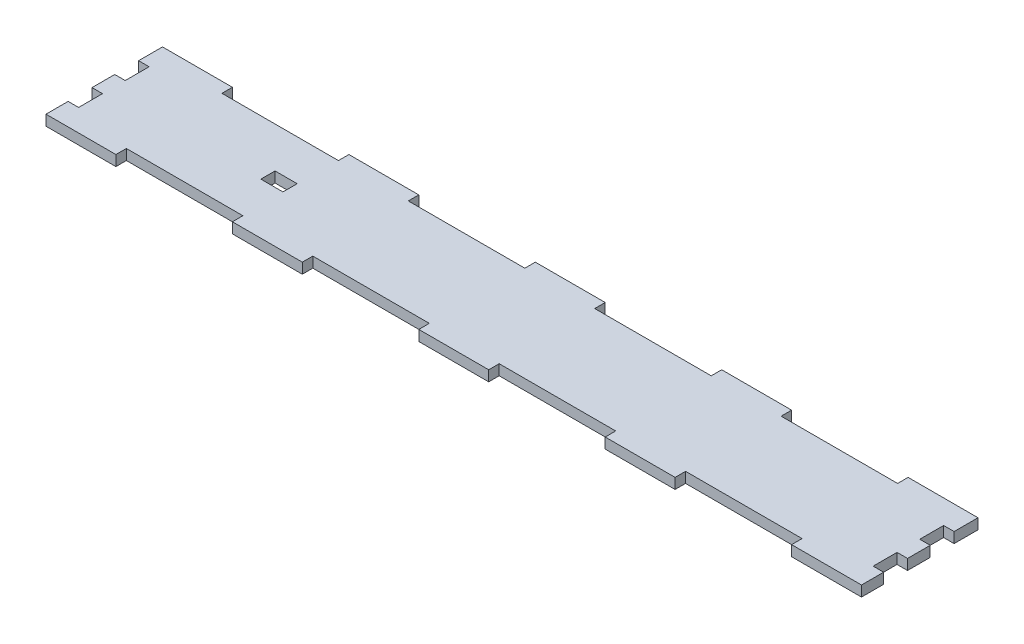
ISO-10303-21;
HEADER;
FILE_DESCRIPTION(('STEP AP214'),'2;1');
FILE_NAME('part.step','',(''),(''),'','','');
FILE_SCHEMA(('AUTOMOTIVE_DESIGN { 1 0 10303 214 1 1 1 1 }'));
ENDSEC;
DATA;
#1=APPLICATION_CONTEXT('core data for automotive mechanical design processes');
#2=APPLICATION_PROTOCOL_DEFINITION('international standard','automotive_design',2000,#1);
#3=PRODUCT_CONTEXT('',#1,'mechanical');
#4=PRODUCT('Part','Part','',(#3));
#5=PRODUCT_RELATED_PRODUCT_CATEGORY('part','',(#4));
#6=PRODUCT_DEFINITION_FORMATION('','',#4);
#7=PRODUCT_DEFINITION_CONTEXT('part definition',#1,'design');
#8=PRODUCT_DEFINITION('design','',#6,#7);
#9=PRODUCT_DEFINITION_SHAPE('','',#8);
#10=(LENGTH_UNIT() NAMED_UNIT(*) SI_UNIT(.MILLI.,.METRE.));
#11=(NAMED_UNIT(*) PLANE_ANGLE_UNIT() SI_UNIT($,.RADIAN.));
#12=(NAMED_UNIT(*) SI_UNIT($,.STERADIAN.) SOLID_ANGLE_UNIT());
#13=UNCERTAINTY_MEASURE_WITH_UNIT(LENGTH_MEASURE(1.E-05),#10,'distance_accuracy_value','');
#14=(GEOMETRIC_REPRESENTATION_CONTEXT(3) GLOBAL_UNCERTAINTY_ASSIGNED_CONTEXT((#13)) GLOBAL_UNIT_ASSIGNED_CONTEXT((#10,
#11,#12)) REPRESENTATION_CONTEXT('',''));
#15=CARTESIAN_POINT('',(0.,0.,0.));
#16=DIRECTION('',(0.,0.,1.));
#17=DIRECTION('',(1.,0.,0.));
#18=AXIS2_PLACEMENT_3D('',#15,#16,#17);
#19=CARTESIAN_POINT('',(-350.,9.,-50.));
#20=DIRECTION('',(0.,0.,1.));
#21=DIRECTION('',(1.,0.,0.));
#22=AXIS2_PLACEMENT_3D('',#19,#20,#21);
#23=PLANE('',#22);
#24=DIRECTION('',(-1.,0.,0.));
#25=VECTOR('',#24,1.);
#26=CARTESIAN_POINT('',(-350.,0.,-50.));
#27=LINE('',#26,#25);
#28=CARTESIAN_POINT('',(30.0000000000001,0.,-50.));
#29=VERTEX_POINT('',#28);
#30=CARTESIAN_POINT('',(-29.9999999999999,0.,-50.));
#31=VERTEX_POINT('',#30);
#32=EDGE_CURVE('E1103',#29,#31,#27,.T.);
#33=ORIENTED_EDGE('',*,*,#32,.T.);
#34=DIRECTION('',(0.,1.,0.));
#35=VECTOR('',#34,1.);
#36=CARTESIAN_POINT('',(-29.9999999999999,0.,-50.));
#37=LINE('',#36,#35);
#38=CARTESIAN_POINT('',(-29.9999999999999,9.,-50.));
#39=VERTEX_POINT('',#38);
#40=EDGE_CURVE('E574',#31,#39,#37,.T.);
#41=ORIENTED_EDGE('',*,*,#40,.T.);
#42=DIRECTION('',(-1.,0.,0.));
#43=VECTOR('',#42,1.);
#44=CARTESIAN_POINT('',(-350.,9.,-50.));
#45=LINE('',#44,#43);
#46=CARTESIAN_POINT('',(30.0000000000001,9.,-50.));
#47=VERTEX_POINT('',#46);
#48=EDGE_CURVE('E1076',#47,#39,#45,.T.);
#49=ORIENTED_EDGE('',*,*,#48,.F.);
#50=DIRECTION('',(0.,1.,0.));
#51=VECTOR('',#50,1.);
#52=CARTESIAN_POINT('',(30.0000000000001,0.,-50.));
#53=LINE('',#52,#51);
#54=EDGE_CURVE('E600',#29,#47,#53,.T.);
#55=ORIENTED_EDGE('',*,*,#54,.F.);
#56=EDGE_LOOP('',(#33,#41,#49,#55));
#57=FACE_BOUND('',#56,.T.);
#58=ADVANCED_FACE('F38',(#57),#23,.F.);
#59=CARTESIAN_POINT('',(190.,0.,-50.));
#60=VERTEX_POINT('',#59);
#61=CARTESIAN_POINT('',(130.,0.,-50.));
#62=VERTEX_POINT('',#61);
#63=EDGE_CURVE('E831',#60,#62,#27,.T.);
#64=ORIENTED_EDGE('',*,*,#63,.T.);
#65=DIRECTION('',(0.,1.,0.));
#66=VECTOR('',#65,1.);
#67=CARTESIAN_POINT('',(130.,0.,-50.));
#68=LINE('',#67,#66);
#69=CARTESIAN_POINT('',(130.,9.,-50.));
#70=VERTEX_POINT('',#69);
#71=EDGE_CURVE('E568',#62,#70,#68,.T.);
#72=ORIENTED_EDGE('',*,*,#71,.T.);
#73=CARTESIAN_POINT('',(190.,9.,-50.));
#74=VERTEX_POINT('',#73);
#75=EDGE_CURVE('E764',#74,#70,#45,.T.);
#76=ORIENTED_EDGE('',*,*,#75,.F.);
#77=DIRECTION('',(0.,1.,0.));
#78=VECTOR('',#77,1.);
#79=CARTESIAN_POINT('',(190.,0.,-50.));
#80=LINE('',#79,#78);
#81=EDGE_CURVE('E636',#60,#74,#80,.T.);
#82=ORIENTED_EDGE('',*,*,#81,.F.);
#83=EDGE_LOOP('',(#64,#72,#76,#82));
#84=FACE_BOUND('',#83,.T.);
#85=ADVANCED_FACE('F1035',(#84),#23,.F.);
#86=CARTESIAN_POINT('',(350.,0.,-50.));
#87=VERTEX_POINT('',#86);
#88=CARTESIAN_POINT('',(290.,0.,-50.));
#89=VERTEX_POINT('',#88);
#90=EDGE_CURVE('E826',#87,#89,#27,.T.);
#91=ORIENTED_EDGE('',*,*,#90,.T.);
#92=DIRECTION('',(0.,1.,0.));
#93=VECTOR('',#92,1.);
#94=CARTESIAN_POINT('',(290.,0.,-50.));
#95=LINE('',#94,#93);
#96=CARTESIAN_POINT('',(290.,9.,-50.));
#97=VERTEX_POINT('',#96);
#98=EDGE_CURVE('E606',#89,#97,#95,.T.);
#99=ORIENTED_EDGE('',*,*,#98,.T.);
#100=CARTESIAN_POINT('',(350.,9.,-50.));
#101=VERTEX_POINT('',#100);
#102=EDGE_CURVE('E759',#101,#97,#45,.T.);
#103=ORIENTED_EDGE('',*,*,#102,.F.);
#104=DIRECTION('',(0.,-1.,0.));
#105=VECTOR('',#104,1.);
#106=CARTESIAN_POINT('',(350.,9.,-50.));
#107=LINE('',#106,#105);
#108=EDGE_CURVE('E906',#101,#87,#107,.T.);
#109=ORIENTED_EDGE('',*,*,#108,.T.);
#110=EDGE_LOOP('',(#91,#99,#103,#109));
#111=FACE_BOUND('',#110,.T.);
#112=ADVANCED_FACE('F1042',(#111),#23,.F.);
#113=CARTESIAN_POINT('',(-290.,9.,-50.));
#114=VERTEX_POINT('',#113);
#115=CARTESIAN_POINT('',(-350.,9.,-50.));
#116=VERTEX_POINT('',#115);
#117=EDGE_CURVE('E758',#114,#116,#45,.T.);
#118=ORIENTED_EDGE('',*,*,#117,.F.);
#119=DIRECTION('',(0.,1.,0.));
#120=VECTOR('',#119,1.);
#121=CARTESIAN_POINT('',(-290.,0.,-50.));
#122=LINE('',#121,#120);
#123=CARTESIAN_POINT('',(-290.,0.,-50.));
#124=VERTEX_POINT('',#123);
#125=EDGE_CURVE('E716',#124,#114,#122,.T.);
#126=ORIENTED_EDGE('',*,*,#125,.F.);
#127=CARTESIAN_POINT('',(-350.,0.,-50.));
#128=VERTEX_POINT('',#127);
#129=EDGE_CURVE('E825',#124,#128,#27,.T.);
#130=ORIENTED_EDGE('',*,*,#129,.T.);
#131=DIRECTION('',(0.,-1.,0.));
#132=VECTOR('',#131,1.);
#133=CARTESIAN_POINT('',(-350.,9.,-50.));
#134=LINE('',#133,#132);
#135=EDGE_CURVE('E902',#116,#128,#134,.T.);
#136=ORIENTED_EDGE('',*,*,#135,.F.);
#137=EDGE_LOOP('',(#118,#126,#130,#136));
#138=FACE_BOUND('',#137,.T.);
#139=ADVANCED_FACE('F1031',(#138),#23,.F.);
#140=CARTESIAN_POINT('',(-350.,9.,50.));
#141=DIRECTION('',(0.,0.,-1.));
#142=DIRECTION('',(-1.,0.,0.));
#143=AXIS2_PLACEMENT_3D('',#140,#141,#142);
#144=PLANE('',#143);
#145=DIRECTION('',(1.,0.,0.));
#146=VECTOR('',#145,1.);
#147=CARTESIAN_POINT('',(-350.,0.,50.));
#148=LINE('',#147,#146);
#149=CARTESIAN_POINT('',(130.,0.,50.));
#150=VERTEX_POINT('',#149);
#151=CARTESIAN_POINT('',(190.,0.,50.));
#152=VERTEX_POINT('',#151);
#153=EDGE_CURVE('E968',#150,#152,#148,.T.);
#154=ORIENTED_EDGE('',*,*,#153,.T.);
#155=DIRECTION('',(0.,1.,0.));
#156=VECTOR('',#155,1.);
#157=CARTESIAN_POINT('',(190.,0.,50.));
#158=LINE('',#157,#156);
#159=CARTESIAN_POINT('',(190.,9.,50.));
#160=VERTEX_POINT('',#159);
#161=EDGE_CURVE('E672',#152,#160,#158,.T.);
#162=ORIENTED_EDGE('',*,*,#161,.T.);
#163=DIRECTION('',(1.,0.,0.));
#164=VECTOR('',#163,1.);
#165=CARTESIAN_POINT('',(-350.,9.,50.));
#166=LINE('',#165,#164);
#167=CARTESIAN_POINT('',(130.,9.,50.));
#168=VERTEX_POINT('',#167);
#169=EDGE_CURVE('E1000',#168,#160,#166,.T.);
#170=ORIENTED_EDGE('',*,*,#169,.F.);
#171=DIRECTION('',(0.,1.,0.));
#172=VECTOR('',#171,1.);
#173=CARTESIAN_POINT('',(130.,0.,50.));
#174=LINE('',#173,#172);
#175=EDGE_CURVE('E473',#150,#168,#174,.T.);
#176=ORIENTED_EDGE('',*,*,#175,.F.);
#177=EDGE_LOOP('',(#154,#162,#170,#176));
#178=FACE_BOUND('',#177,.T.);
#179=ADVANCED_FACE('F1016',(#178),#144,.F.);
#180=CARTESIAN_POINT('',(-29.9999999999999,0.,50.));
#181=VERTEX_POINT('',#180);
#182=CARTESIAN_POINT('',(30.0000000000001,0.,50.));
#183=VERTEX_POINT('',#182);
#184=EDGE_CURVE('E971',#181,#183,#148,.T.);
#185=ORIENTED_EDGE('',*,*,#184,.T.);
#186=DIRECTION('',(0.,1.,0.));
#187=VECTOR('',#186,1.);
#188=CARTESIAN_POINT('',(30.0000000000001,0.,50.));
#189=LINE('',#188,#187);
#190=CARTESIAN_POINT('',(30.0000000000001,9.,50.));
#191=VERTEX_POINT('',#190);
#192=EDGE_CURVE('E454',#183,#191,#189,.T.);
#193=ORIENTED_EDGE('',*,*,#192,.T.);
#194=CARTESIAN_POINT('',(-29.9999999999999,9.,50.));
#195=VERTEX_POINT('',#194);
#196=EDGE_CURVE('E997',#195,#191,#166,.T.);
#197=ORIENTED_EDGE('',*,*,#196,.F.);
#198=DIRECTION('',(0.,1.,0.));
#199=VECTOR('',#198,1.);
#200=CARTESIAN_POINT('',(-29.9999999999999,0.,50.));
#201=LINE('',#200,#199);
#202=EDGE_CURVE('E509',#181,#195,#201,.T.);
#203=ORIENTED_EDGE('',*,*,#202,.F.);
#204=EDGE_LOOP('',(#185,#193,#197,#203));
#205=FACE_BOUND('',#204,.T.);
#206=ADVANCED_FACE('F1030',(#205),#144,.F.);
#207=CARTESIAN_POINT('',(-190.,0.,50.));
#208=VERTEX_POINT('',#207);
#209=CARTESIAN_POINT('',(-130.,0.,50.));
#210=VERTEX_POINT('',#209);
#211=EDGE_CURVE('E862',#208,#210,#148,.T.);
#212=ORIENTED_EDGE('',*,*,#211,.T.);
#213=DIRECTION('',(0.,1.,0.));
#214=VECTOR('',#213,1.);
#215=CARTESIAN_POINT('',(-130.,0.,50.));
#216=LINE('',#215,#214);
#217=CARTESIAN_POINT('',(-130.,9.,50.));
#218=VERTEX_POINT('',#217);
#219=EDGE_CURVE('E492',#210,#218,#216,.T.);
#220=ORIENTED_EDGE('',*,*,#219,.T.);
#221=CARTESIAN_POINT('',(-190.,9.,50.));
#222=VERTEX_POINT('',#221);
#223=EDGE_CURVE('E797',#222,#218,#166,.T.);
#224=ORIENTED_EDGE('',*,*,#223,.F.);
#225=DIRECTION('',(0.,1.,0.));
#226=VECTOR('',#225,1.);
#227=CARTESIAN_POINT('',(-190.,0.,50.));
#228=LINE('',#227,#226);
#229=EDGE_CURVE('E543',#208,#222,#228,.T.);
#230=ORIENTED_EDGE('',*,*,#229,.F.);
#231=EDGE_LOOP('',(#212,#220,#224,#230));
#232=FACE_BOUND('',#231,.T.);
#233=ADVANCED_FACE('F985',(#232),#144,.F.);
#234=CARTESIAN_POINT('',(-350.,0.,50.));
#235=VERTEX_POINT('',#234);
#236=CARTESIAN_POINT('',(-290.,0.,50.));
#237=VERTEX_POINT('',#236);
#238=EDGE_CURVE('E734',#235,#237,#148,.T.);
#239=ORIENTED_EDGE('',*,*,#238,.T.);
#240=DIRECTION('',(0.,1.,0.));
#241=VECTOR('',#240,1.);
#242=CARTESIAN_POINT('',(-290.,0.,50.));
#243=LINE('',#242,#241);
#244=CARTESIAN_POINT('',(-290.,9.,50.));
#245=VERTEX_POINT('',#244);
#246=EDGE_CURVE('E528',#237,#245,#243,.T.);
#247=ORIENTED_EDGE('',*,*,#246,.T.);
#248=CARTESIAN_POINT('',(-350.,9.,50.));
#249=VERTEX_POINT('',#248);
#250=EDGE_CURVE('E792',#249,#245,#166,.T.);
#251=ORIENTED_EDGE('',*,*,#250,.F.);
#252=DIRECTION('',(0.,-1.,0.));
#253=VECTOR('',#252,1.);
#254=CARTESIAN_POINT('',(-350.,9.,50.));
#255=LINE('',#254,#253);
#256=EDGE_CURVE('E866',#249,#235,#255,.T.);
#257=ORIENTED_EDGE('',*,*,#256,.T.);
#258=EDGE_LOOP('',(#239,#247,#251,#257));
#259=FACE_BOUND('',#258,.T.);
#260=ADVANCED_FACE('F1017',(#259),#144,.F.);
#261=CARTESIAN_POINT('',(349.999999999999,9.,31.));
#262=DIRECTION('',(-1.,0.,0.));
#263=DIRECTION('',(0.,0.,1.));
#264=AXIS2_PLACEMENT_3D('',#261,#262,#263);
#265=PLANE('',#264);
#266=DIRECTION('',(0.,0.,-1.));
#267=VECTOR('',#266,1.);
#268=CARTESIAN_POINT('',(349.999999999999,0.,31.));
#269=LINE('',#268,#267);
#270=CARTESIAN_POINT('',(350.,0.,50.));
#271=VERTEX_POINT('',#270);
#272=CARTESIAN_POINT('',(349.999999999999,0.,31.));
#273=VERTEX_POINT('',#272);
#274=EDGE_CURVE('E719',#271,#273,#269,.T.);
#275=ORIENTED_EDGE('',*,*,#274,.T.);
#276=DIRECTION('',(0.,-1.,0.));
#277=VECTOR('',#276,1.);
#278=CARTESIAN_POINT('',(349.999999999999,9.,31.));
#279=LINE('',#278,#277);
#280=CARTESIAN_POINT('',(349.999999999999,9.,31.));
#281=VERTEX_POINT('',#280);
#282=EDGE_CURVE('E11',#281,#273,#279,.T.);
#283=ORIENTED_EDGE('',*,*,#282,.F.);
#284=DIRECTION('',(0.,0.,-1.));
#285=VECTOR('',#284,1.);
#286=CARTESIAN_POINT('',(349.999999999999,9.,31.));
#287=LINE('',#286,#285);
#288=CARTESIAN_POINT('',(350.,9.,50.));
#289=VERTEX_POINT('',#288);
#290=EDGE_CURVE('E729',#289,#281,#287,.T.);
#291=ORIENTED_EDGE('',*,*,#290,.F.);
#292=DIRECTION('',(0.,-1.,0.));
#293=VECTOR('',#292,1.);
#294=CARTESIAN_POINT('',(350.,9.,50.));
#295=LINE('',#294,#293);
#296=EDGE_CURVE('E796',#289,#271,#295,.T.);
#297=ORIENTED_EDGE('',*,*,#296,.T.);
#298=EDGE_LOOP('',(#275,#283,#291,#297));
#299=FACE_BOUND('',#298,.T.);
#300=ADVANCED_FACE('F40',(#299),#265,.F.);
#301=CARTESIAN_POINT('',(349.999999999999,9.,31.));
#302=DIRECTION('',(0.,0.,1.));
#303=DIRECTION('',(1.,0.,0.));
#304=AXIS2_PLACEMENT_3D('',#301,#302,#303);
#305=PLANE('',#304);
#306=DIRECTION('',(-1.,0.,0.));
#307=VECTOR('',#306,1.);
#308=CARTESIAN_POINT('',(349.999999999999,0.,31.));
#309=LINE('',#308,#307);
#310=CARTESIAN_POINT('',(341.,0.,30.9999999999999));
#311=VERTEX_POINT('',#310);
#312=EDGE_CURVE('E801',#273,#311,#309,.T.);
#313=ORIENTED_EDGE('',*,*,#312,.T.);
#314=DIRECTION('',(0.,-1.,0.));
#315=VECTOR('',#314,1.);
#316=CARTESIAN_POINT('',(341.,9.,30.9999999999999));
#317=LINE('',#316,#315);
#318=CARTESIAN_POINT('',(341.,9.,30.9999999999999));
#319=VERTEX_POINT('',#318);
#320=EDGE_CURVE('E47',#319,#311,#317,.T.);
#321=ORIENTED_EDGE('',*,*,#320,.F.);
#322=DIRECTION('',(-1.,0.,0.));
#323=VECTOR('',#322,1.);
#324=CARTESIAN_POINT('',(349.999999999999,9.,31.));
#325=LINE('',#324,#323);
#326=EDGE_CURVE('E733',#281,#319,#325,.T.);
#327=ORIENTED_EDGE('',*,*,#326,.F.);
#328=ORIENTED_EDGE('',*,*,#282,.T.);
#329=EDGE_LOOP('',(#313,#321,#327,#328));
#330=FACE_BOUND('',#329,.T.);
#331=ADVANCED_FACE('F961',(#330),#305,.F.);
#332=CARTESIAN_POINT('',(341.,9.,10.4999999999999));
#333=DIRECTION('',(-1.,0.,0.));
#334=DIRECTION('',(0.,0.,1.));
#335=AXIS2_PLACEMENT_3D('',#332,#333,#334);
#336=PLANE('',#335);
#337=DIRECTION('',(0.,0.,-1.));
#338=VECTOR('',#337,1.);
#339=CARTESIAN_POINT('',(341.,0.,10.4999999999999));
#340=LINE('',#339,#338);
#341=CARTESIAN_POINT('',(341.,0.,10.4999999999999));
#342=VERTEX_POINT('',#341);
#343=EDGE_CURVE('E804',#311,#342,#340,.T.);
#344=ORIENTED_EDGE('',*,*,#343,.T.);
#345=DIRECTION('',(0.,-1.,0.));
#346=VECTOR('',#345,1.);
#347=CARTESIAN_POINT('',(341.,9.,10.4999999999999));
#348=LINE('',#347,#346);
#349=CARTESIAN_POINT('',(341.,9.,10.4999999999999));
#350=VERTEX_POINT('',#349);
#351=EDGE_CURVE('E930',#350,#342,#348,.T.);
#352=ORIENTED_EDGE('',*,*,#351,.F.);
#353=DIRECTION('',(0.,0.,-1.));
#354=VECTOR('',#353,1.);
#355=CARTESIAN_POINT('',(341.,9.,10.4999999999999));
#356=LINE('',#355,#354);
#357=EDGE_CURVE('E737',#319,#350,#356,.T.);
#358=ORIENTED_EDGE('',*,*,#357,.F.);
#359=ORIENTED_EDGE('',*,*,#320,.T.);
#360=EDGE_LOOP('',(#344,#352,#358,#359));
#361=FACE_BOUND('',#360,.T.);
#362=ADVANCED_FACE('F939',(#361),#336,.F.);
#363=CARTESIAN_POINT('',(349.999999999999,9.,10.5));
#364=DIRECTION('',(0.,0.,-1.));
#365=DIRECTION('',(-1.,0.,0.));
#366=AXIS2_PLACEMENT_3D('',#363,#364,#365);
#367=PLANE('',#366);
#368=DIRECTION('',(1.,0.,0.));
#369=VECTOR('',#368,1.);
#370=CARTESIAN_POINT('',(349.999999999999,0.,10.5));
#371=LINE('',#370,#369);
#372=CARTESIAN_POINT('',(349.999999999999,0.,10.5));
#373=VERTEX_POINT('',#372);
#374=EDGE_CURVE('E807',#342,#373,#371,.T.);
#375=ORIENTED_EDGE('',*,*,#374,.T.);
#376=DIRECTION('',(0.,-1.,0.));
#377=VECTOR('',#376,1.);
#378=CARTESIAN_POINT('',(349.999999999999,9.,10.5));
#379=LINE('',#378,#377);
#380=CARTESIAN_POINT('',(349.999999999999,9.,10.5));
#381=VERTEX_POINT('',#380);
#382=EDGE_CURVE('E926',#381,#373,#379,.T.);
#383=ORIENTED_EDGE('',*,*,#382,.F.);
#384=DIRECTION('',(1.,0.,0.));
#385=VECTOR('',#384,1.);
#386=CARTESIAN_POINT('',(349.999999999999,9.,10.5));
#387=LINE('',#386,#385);
#388=EDGE_CURVE('E740',#350,#381,#387,.T.);
#389=ORIENTED_EDGE('',*,*,#388,.F.);
#390=ORIENTED_EDGE('',*,*,#351,.T.);
#391=EDGE_LOOP('',(#375,#383,#389,#390));
#392=FACE_BOUND('',#391,.T.);
#393=ADVANCED_FACE('F948',(#392),#367,.F.);
#394=CARTESIAN_POINT('',(350.,9.,-9.00000000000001));
#395=DIRECTION('',(-1.,0.,0.));
#396=DIRECTION('',(0.,0.,1.));
#397=AXIS2_PLACEMENT_3D('',#394,#395,#396);
#398=PLANE('',#397);
#399=DIRECTION('',(0.,0.,-1.));
#400=VECTOR('',#399,1.);
#401=CARTESIAN_POINT('',(350.,0.,-9.00000000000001));
#402=LINE('',#401,#400);
#403=CARTESIAN_POINT('',(350.,0.,-9.00000000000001));
#404=VERTEX_POINT('',#403);
#405=EDGE_CURVE('E810',#373,#404,#402,.T.);
#406=ORIENTED_EDGE('',*,*,#405,.T.);
#407=DIRECTION('',(0.,-1.,0.));
#408=VECTOR('',#407,1.);
#409=CARTESIAN_POINT('',(350.,9.,-9.00000000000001));
#410=LINE('',#409,#408);
#411=CARTESIAN_POINT('',(350.,9.,-9.00000000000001));
#412=VERTEX_POINT('',#411);
#413=EDGE_CURVE('E922',#412,#404,#410,.T.);
#414=ORIENTED_EDGE('',*,*,#413,.F.);
#415=DIRECTION('',(0.,0.,-1.));
#416=VECTOR('',#415,1.);
#417=CARTESIAN_POINT('',(350.,9.,-9.00000000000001));
#418=LINE('',#417,#416);
#419=EDGE_CURVE('E743',#381,#412,#418,.T.);
#420=ORIENTED_EDGE('',*,*,#419,.F.);
#421=ORIENTED_EDGE('',*,*,#382,.T.);
#422=EDGE_LOOP('',(#406,#414,#420,#421));
#423=FACE_BOUND('',#422,.T.);
#424=ADVANCED_FACE('F952',(#423),#398,.F.);
#425=CARTESIAN_POINT('',(350.,9.,-9.00000000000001));
#426=DIRECTION('',(0.,0.,1.));
#427=DIRECTION('',(1.,0.,0.));
#428=AXIS2_PLACEMENT_3D('',#425,#426,#427);
#429=PLANE('',#428);
#430=DIRECTION('',(-1.,0.,0.));
#431=VECTOR('',#430,1.);
#432=CARTESIAN_POINT('',(350.,0.,-9.00000000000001));
#433=LINE('',#432,#431);
#434=CARTESIAN_POINT('',(341.,0.,-9.0000000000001));
#435=VERTEX_POINT('',#434);
#436=EDGE_CURVE('E813',#404,#435,#433,.T.);
#437=ORIENTED_EDGE('',*,*,#436,.T.);
#438=DIRECTION('',(0.,-1.,0.));
#439=VECTOR('',#438,1.);
#440=CARTESIAN_POINT('',(341.,9.,-9.0000000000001));
#441=LINE('',#440,#439);
#442=CARTESIAN_POINT('',(341.,9.,-9.0000000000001));
#443=VERTEX_POINT('',#442);
#444=EDGE_CURVE('E918',#443,#435,#441,.T.);
#445=ORIENTED_EDGE('',*,*,#444,.F.);
#446=DIRECTION('',(-1.,0.,0.));
#447=VECTOR('',#446,1.);
#448=CARTESIAN_POINT('',(350.,9.,-9.00000000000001));
#449=LINE('',#448,#447);
#450=EDGE_CURVE('E746',#412,#443,#449,.T.);
#451=ORIENTED_EDGE('',*,*,#450,.F.);
#452=ORIENTED_EDGE('',*,*,#413,.T.);
#453=EDGE_LOOP('',(#437,#445,#451,#452));
#454=FACE_BOUND('',#453,.T.);
#455=ADVANCED_FACE('F1509',(#454),#429,.F.);
#456=CARTESIAN_POINT('',(341.,9.,-29.5000000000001));
#457=DIRECTION('',(-1.,0.,0.));
#458=DIRECTION('',(0.,0.,1.));
#459=AXIS2_PLACEMENT_3D('',#456,#457,#458);
#460=PLANE('',#459);
#461=DIRECTION('',(0.,0.,-1.));
#462=VECTOR('',#461,1.);
#463=CARTESIAN_POINT('',(341.,0.,-29.5000000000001));
#464=LINE('',#463,#462);
#465=CARTESIAN_POINT('',(341.,0.,-29.5000000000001));
#466=VERTEX_POINT('',#465);
#467=EDGE_CURVE('E816',#435,#466,#464,.T.);
#468=ORIENTED_EDGE('',*,*,#467,.T.);
#469=DIRECTION('',(0.,-1.,0.));
#470=VECTOR('',#469,1.);
#471=CARTESIAN_POINT('',(341.,9.,-29.5000000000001));
#472=LINE('',#471,#470);
#473=CARTESIAN_POINT('',(341.,9.,-29.5000000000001));
#474=VERTEX_POINT('',#473);
#475=EDGE_CURVE('E914',#474,#466,#472,.T.);
#476=ORIENTED_EDGE('',*,*,#475,.F.);
#477=DIRECTION('',(0.,0.,-1.));
#478=VECTOR('',#477,1.);
#479=CARTESIAN_POINT('',(341.,9.,-29.5000000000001));
#480=LINE('',#479,#478);
#481=EDGE_CURVE('E749',#443,#474,#480,.T.);
#482=ORIENTED_EDGE('',*,*,#481,.F.);
#483=ORIENTED_EDGE('',*,*,#444,.T.);
#484=EDGE_LOOP('',(#468,#476,#482,#483));
#485=FACE_BOUND('',#484,.T.);
#486=ADVANCED_FACE('F1500',(#485),#460,.F.);
#487=CARTESIAN_POINT('',(350.,9.,-29.5));
#488=DIRECTION('',(0.,0.,-1.));
#489=DIRECTION('',(-1.,0.,0.));
#490=AXIS2_PLACEMENT_3D('',#487,#488,#489);
#491=PLANE('',#490);
#492=DIRECTION('',(1.,0.,0.));
#493=VECTOR('',#492,1.);
#494=CARTESIAN_POINT('',(350.,0.,-29.5));
#495=LINE('',#494,#493);
#496=CARTESIAN_POINT('',(350.,0.,-29.5));
#497=VERTEX_POINT('',#496);
#498=EDGE_CURVE('E819',#466,#497,#495,.T.);
#499=ORIENTED_EDGE('',*,*,#498,.T.);
#500=DIRECTION('',(0.,-1.,0.));
#501=VECTOR('',#500,1.);
#502=CARTESIAN_POINT('',(350.,9.,-29.5));
#503=LINE('',#502,#501);
#504=CARTESIAN_POINT('',(350.,9.,-29.5));
#505=VERTEX_POINT('',#504);
#506=EDGE_CURVE('E910',#505,#497,#503,.T.);
#507=ORIENTED_EDGE('',*,*,#506,.F.);
#508=DIRECTION('',(1.,0.,0.));
#509=VECTOR('',#508,1.);
#510=CARTESIAN_POINT('',(350.,9.,-29.5));
#511=LINE('',#510,#509);
#512=EDGE_CURVE('E752',#474,#505,#511,.T.);
#513=ORIENTED_EDGE('',*,*,#512,.F.);
#514=ORIENTED_EDGE('',*,*,#475,.T.);
#515=EDGE_LOOP('',(#499,#507,#513,#514));
#516=FACE_BOUND('',#515,.T.);
#517=ADVANCED_FACE('F1057',(#516),#491,.F.);
#518=CARTESIAN_POINT('',(350.,9.,-50.));
#519=DIRECTION('',(-1.,0.,0.));
#520=DIRECTION('',(0.,0.,1.));
#521=AXIS2_PLACEMENT_3D('',#518,#519,#520);
#522=PLANE('',#521);
#523=DIRECTION('',(0.,0.,-1.));
#524=VECTOR('',#523,1.);
#525=CARTESIAN_POINT('',(350.,0.,-50.));
#526=LINE('',#525,#524);
#527=EDGE_CURVE('E822',#497,#87,#526,.T.);
#528=ORIENTED_EDGE('',*,*,#527,.T.);
#529=ORIENTED_EDGE('',*,*,#108,.F.);
#530=DIRECTION('',(0.,0.,-1.));
#531=VECTOR('',#530,1.);
#532=CARTESIAN_POINT('',(350.,9.,-50.));
#533=LINE('',#532,#531);
#534=EDGE_CURVE('E755',#505,#101,#533,.T.);
#535=ORIENTED_EDGE('',*,*,#534,.F.);
#536=ORIENTED_EDGE('',*,*,#506,.T.);
#537=EDGE_LOOP('',(#528,#529,#535,#536));
#538=FACE_BOUND('',#537,.T.);
#539=ADVANCED_FACE('F1049',(#538),#522,.F.);
#540=CARTESIAN_POINT('',(-130.,9.,-50.));
#541=VERTEX_POINT('',#540);
#542=CARTESIAN_POINT('',(-190.,9.,-50.));
#543=VERTEX_POINT('',#542);
#544=EDGE_CURVE('E1073',#541,#543,#45,.T.);
#545=ORIENTED_EDGE('',*,*,#544,.F.);
#546=DIRECTION('',(0.,1.,0.));
#547=VECTOR('',#546,1.);
#548=CARTESIAN_POINT('',(-130.,0.,-50.));
#549=LINE('',#548,#547);
#550=CARTESIAN_POINT('',(-130.,0.,-50.));
#551=VERTEX_POINT('',#550);
#552=EDGE_CURVE('E562',#551,#541,#549,.T.);
#553=ORIENTED_EDGE('',*,*,#552,.F.);
#554=CARTESIAN_POINT('',(-190.,0.,-50.));
#555=VERTEX_POINT('',#554);
#556=EDGE_CURVE('E1116',#551,#555,#27,.T.);
#557=ORIENTED_EDGE('',*,*,#556,.T.);
#558=DIRECTION('',(0.,1.,0.));
#559=VECTOR('',#558,1.);
#560=CARTESIAN_POINT('',(-190.,0.,-50.));
#561=LINE('',#560,#559);
#562=EDGE_CURVE('E720',#555,#543,#561,.T.);
#563=ORIENTED_EDGE('',*,*,#562,.T.);
#564=EDGE_LOOP('',(#545,#553,#557,#563));
#565=FACE_BOUND('',#564,.T.);
#566=ADVANCED_FACE('F1038',(#565),#23,.F.);
#567=CARTESIAN_POINT('',(-350.,9.,-50.));
#568=DIRECTION('',(1.,0.,0.));
#569=DIRECTION('',(0.,0.,-1.));
#570=AXIS2_PLACEMENT_3D('',#567,#568,#569);
#571=PLANE('',#570);
#572=DIRECTION('',(0.,0.,1.));
#573=VECTOR('',#572,1.);
#574=CARTESIAN_POINT('',(-350.,0.,-50.));
#575=LINE('',#574,#573);
#576=CARTESIAN_POINT('',(-350.,0.,-29.5));
#577=VERTEX_POINT('',#576);
#578=EDGE_CURVE('E830',#128,#577,#575,.T.);
#579=ORIENTED_EDGE('',*,*,#578,.T.);
#580=DIRECTION('',(0.,-1.,0.));
#581=VECTOR('',#580,1.);
#582=CARTESIAN_POINT('',(-350.,9.,-29.5));
#583=LINE('',#582,#581);
#584=CARTESIAN_POINT('',(-350.,9.,-29.5));
#585=VERTEX_POINT('',#584);
#586=EDGE_CURVE('E898',#585,#577,#583,.T.);
#587=ORIENTED_EDGE('',*,*,#586,.F.);
#588=DIRECTION('',(0.,0.,1.));
#589=VECTOR('',#588,1.);
#590=CARTESIAN_POINT('',(-350.,9.,-50.));
#591=LINE('',#590,#589);
#592=EDGE_CURVE('E763',#116,#585,#591,.T.);
#593=ORIENTED_EDGE('',*,*,#592,.F.);
#594=ORIENTED_EDGE('',*,*,#135,.T.);
#595=EDGE_LOOP('',(#579,#587,#593,#594));
#596=FACE_BOUND('',#595,.T.);
#597=ADVANCED_FACE('F1048',(#596),#571,.F.);
#598=CARTESIAN_POINT('',(-350.,9.,-29.5));
#599=DIRECTION('',(0.,0.,-1.));
#600=DIRECTION('',(-1.,0.,0.));
#601=AXIS2_PLACEMENT_3D('',#598,#599,#600);
#602=PLANE('',#601);
#603=DIRECTION('',(1.,0.,0.));
#604=VECTOR('',#603,1.);
#605=CARTESIAN_POINT('',(-350.,0.,-29.5));
#606=LINE('',#605,#604);
#607=CARTESIAN_POINT('',(-341.,0.,-29.5));
#608=VERTEX_POINT('',#607);
#609=EDGE_CURVE('E834',#577,#608,#606,.T.);
#610=ORIENTED_EDGE('',*,*,#609,.T.);
#611=DIRECTION('',(0.,-1.,0.));
#612=VECTOR('',#611,1.);
#613=CARTESIAN_POINT('',(-341.,9.,-29.5));
#614=LINE('',#613,#612);
#615=CARTESIAN_POINT('',(-341.,9.,-29.5));
#616=VERTEX_POINT('',#615);
#617=EDGE_CURVE('E894',#616,#608,#614,.T.);
#618=ORIENTED_EDGE('',*,*,#617,.F.);
#619=DIRECTION('',(1.,0.,0.));
#620=VECTOR('',#619,1.);
#621=CARTESIAN_POINT('',(-350.,9.,-29.5));
#622=LINE('',#621,#620);
#623=EDGE_CURVE('E767',#585,#616,#622,.T.);
#624=ORIENTED_EDGE('',*,*,#623,.F.);
#625=ORIENTED_EDGE('',*,*,#586,.T.);
#626=EDGE_LOOP('',(#610,#618,#624,#625));
#627=FACE_BOUND('',#626,.T.);
#628=ADVANCED_FACE('F1055',(#627),#602,.F.);
#629=CARTESIAN_POINT('',(-341.,9.,-29.5));
#630=DIRECTION('',(1.,0.,0.));
#631=DIRECTION('',(0.,0.,-1.));
#632=AXIS2_PLACEMENT_3D('',#629,#630,#631);
#633=PLANE('',#632);
#634=DIRECTION('',(0.,0.,1.));
#635=VECTOR('',#634,1.);
#636=CARTESIAN_POINT('',(-341.,0.,-29.5));
#637=LINE('',#636,#635);
#638=CARTESIAN_POINT('',(-341.,0.,-9.00000000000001));
#639=VERTEX_POINT('',#638);
#640=EDGE_CURVE('E837',#608,#639,#637,.T.);
#641=ORIENTED_EDGE('',*,*,#640,.T.);
#642=DIRECTION('',(0.,-1.,0.));
#643=VECTOR('',#642,1.);
#644=CARTESIAN_POINT('',(-341.,9.,-9.00000000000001));
#645=LINE('',#644,#643);
#646=CARTESIAN_POINT('',(-341.,9.,-9.00000000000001));
#647=VERTEX_POINT('',#646);
#648=EDGE_CURVE('E890',#647,#639,#645,.T.);
#649=ORIENTED_EDGE('',*,*,#648,.F.);
#650=DIRECTION('',(0.,0.,1.));
#651=VECTOR('',#650,1.);
#652=CARTESIAN_POINT('',(-341.,9.,-29.5));
#653=LINE('',#652,#651);
#654=EDGE_CURVE('E770',#616,#647,#653,.T.);
#655=ORIENTED_EDGE('',*,*,#654,.F.);
#656=ORIENTED_EDGE('',*,*,#617,.T.);
#657=EDGE_LOOP('',(#641,#649,#655,#656));
#658=FACE_BOUND('',#657,.T.);
#659=ADVANCED_FACE('F1461',(#658),#633,.F.);
#660=CARTESIAN_POINT('',(-350.,9.,-9.00000000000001));
#661=DIRECTION('',(0.,0.,1.));
#662=DIRECTION('',(1.,0.,0.));
#663=AXIS2_PLACEMENT_3D('',#660,#661,#662);
#664=PLANE('',#663);
#665=DIRECTION('',(-1.,0.,0.));
#666=VECTOR('',#665,1.);
#667=CARTESIAN_POINT('',(-350.,0.,-9.00000000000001));
#668=LINE('',#667,#666);
#669=CARTESIAN_POINT('',(-350.,0.,-9.00000000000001));
#670=VERTEX_POINT('',#669);
#671=EDGE_CURVE('E840',#639,#670,#668,.T.);
#672=ORIENTED_EDGE('',*,*,#671,.T.);
#673=DIRECTION('',(0.,-1.,0.));
#674=VECTOR('',#673,1.);
#675=CARTESIAN_POINT('',(-350.,9.,-9.00000000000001));
#676=LINE('',#675,#674);
#677=CARTESIAN_POINT('',(-350.,9.,-9.00000000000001));
#678=VERTEX_POINT('',#677);
#679=EDGE_CURVE('E886',#678,#670,#676,.T.);
#680=ORIENTED_EDGE('',*,*,#679,.F.);
#681=DIRECTION('',(-1.,0.,0.));
#682=VECTOR('',#681,1.);
#683=CARTESIAN_POINT('',(-350.,9.,-9.00000000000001));
#684=LINE('',#683,#682);
#685=EDGE_CURVE('E773',#647,#678,#684,.T.);
#686=ORIENTED_EDGE('',*,*,#685,.F.);
#687=ORIENTED_EDGE('',*,*,#648,.T.);
#688=EDGE_LOOP('',(#672,#680,#686,#687));
#689=FACE_BOUND('',#688,.T.);
#690=ADVANCED_FACE('F1452',(#689),#664,.F.);
#691=CARTESIAN_POINT('',(-350.,9.,-9.00000000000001));
#692=DIRECTION('',(1.,0.,0.));
#693=DIRECTION('',(0.,0.,-1.));
#694=AXIS2_PLACEMENT_3D('',#691,#692,#693);
#695=PLANE('',#694);
#696=DIRECTION('',(0.,0.,1.));
#697=VECTOR('',#696,1.);
#698=CARTESIAN_POINT('',(-350.,0.,-9.00000000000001));
#699=LINE('',#698,#697);
#700=CARTESIAN_POINT('',(-349.999999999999,0.,10.5));
#701=VERTEX_POINT('',#700);
#702=EDGE_CURVE('E843',#670,#701,#699,.T.);
#703=ORIENTED_EDGE('',*,*,#702,.T.);
#704=DIRECTION('',(0.,-1.,0.));
#705=VECTOR('',#704,1.);
#706=CARTESIAN_POINT('',(-349.999999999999,9.,10.5));
#707=LINE('',#706,#705);
#708=CARTESIAN_POINT('',(-349.999999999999,9.,10.5));
#709=VERTEX_POINT('',#708);
#710=EDGE_CURVE('E882',#709,#701,#707,.T.);
#711=ORIENTED_EDGE('',*,*,#710,.F.);
#712=DIRECTION('',(0.,0.,1.));
#713=VECTOR('',#712,1.);
#714=CARTESIAN_POINT('',(-350.,9.,-9.00000000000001));
#715=LINE('',#714,#713);
#716=EDGE_CURVE('E776',#678,#709,#715,.T.);
#717=ORIENTED_EDGE('',*,*,#716,.F.);
#718=ORIENTED_EDGE('',*,*,#679,.T.);
#719=EDGE_LOOP('',(#703,#711,#717,#718));
#720=FACE_BOUND('',#719,.T.);
#721=ADVANCED_FACE('F1443',(#720),#695,.F.);
#722=CARTESIAN_POINT('',(-349.999999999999,9.,10.5));
#723=DIRECTION('',(0.,0.,-1.));
#724=DIRECTION('',(-1.,0.,0.));
#725=AXIS2_PLACEMENT_3D('',#722,#723,#724);
#726=PLANE('',#725);
#727=DIRECTION('',(1.,0.,0.));
#728=VECTOR('',#727,1.);
#729=CARTESIAN_POINT('',(-349.999999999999,0.,10.5));
#730=LINE('',#729,#728);
#731=CARTESIAN_POINT('',(-341.,0.,10.5));
#732=VERTEX_POINT('',#731);
#733=EDGE_CURVE('E846',#701,#732,#730,.T.);
#734=ORIENTED_EDGE('',*,*,#733,.T.);
#735=DIRECTION('',(0.,-1.,0.));
#736=VECTOR('',#735,1.);
#737=CARTESIAN_POINT('',(-341.,9.,10.5));
#738=LINE('',#737,#736);
#739=CARTESIAN_POINT('',(-341.,9.,10.5));
#740=VERTEX_POINT('',#739);
#741=EDGE_CURVE('E878',#740,#732,#738,.T.);
#742=ORIENTED_EDGE('',*,*,#741,.F.);
#743=DIRECTION('',(1.,0.,0.));
#744=VECTOR('',#743,1.);
#745=CARTESIAN_POINT('',(-349.999999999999,9.,10.5));
#746=LINE('',#745,#744);
#747=EDGE_CURVE('E779',#709,#740,#746,.T.);
#748=ORIENTED_EDGE('',*,*,#747,.F.);
#749=ORIENTED_EDGE('',*,*,#710,.T.);
#750=EDGE_LOOP('',(#734,#742,#748,#749));
#751=FACE_BOUND('',#750,.T.);
#752=ADVANCED_FACE('F1434',(#751),#726,.F.);
#753=CARTESIAN_POINT('',(-341.,9.,10.5));
#754=DIRECTION('',(1.,0.,0.));
#755=DIRECTION('',(0.,0.,-1.));
#756=AXIS2_PLACEMENT_3D('',#753,#754,#755);
#757=PLANE('',#756);
#758=DIRECTION('',(0.,0.,1.));
#759=VECTOR('',#758,1.);
#760=CARTESIAN_POINT('',(-341.,0.,10.5));
#761=LINE('',#760,#759);
#762=CARTESIAN_POINT('',(-341.,0.,31.));
#763=VERTEX_POINT('',#762);
#764=EDGE_CURVE('E849',#732,#763,#761,.T.);
#765=ORIENTED_EDGE('',*,*,#764,.T.);
#766=DIRECTION('',(0.,-1.,0.));
#767=VECTOR('',#766,1.);
#768=CARTESIAN_POINT('',(-341.,9.,31.));
#769=LINE('',#768,#767);
#770=CARTESIAN_POINT('',(-341.,9.,31.));
#771=VERTEX_POINT('',#770);
#772=EDGE_CURVE('E874',#771,#763,#769,.T.);
#773=ORIENTED_EDGE('',*,*,#772,.F.);
#774=DIRECTION('',(0.,0.,1.));
#775=VECTOR('',#774,1.);
#776=CARTESIAN_POINT('',(-341.,9.,10.5));
#777=LINE('',#776,#775);
#778=EDGE_CURVE('E782',#740,#771,#777,.T.);
#779=ORIENTED_EDGE('',*,*,#778,.F.);
#780=ORIENTED_EDGE('',*,*,#741,.T.);
#781=EDGE_LOOP('',(#765,#773,#779,#780));
#782=FACE_BOUND('',#781,.T.);
#783=ADVANCED_FACE('F1425',(#782),#757,.F.);
#784=CARTESIAN_POINT('',(-349.999999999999,9.,31.));
#785=DIRECTION('',(0.,0.,1.));
#786=DIRECTION('',(1.,0.,0.));
#787=AXIS2_PLACEMENT_3D('',#784,#785,#786);
#788=PLANE('',#787);
#789=DIRECTION('',(-1.,0.,0.));
#790=VECTOR('',#789,1.);
#791=CARTESIAN_POINT('',(-349.999999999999,0.,31.));
#792=LINE('',#791,#790);
#793=CARTESIAN_POINT('',(-349.999999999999,0.,31.));
#794=VERTEX_POINT('',#793);
#795=EDGE_CURVE('E852',#763,#794,#792,.T.);
#796=ORIENTED_EDGE('',*,*,#795,.T.);
#797=DIRECTION('',(0.,-1.,0.));
#798=VECTOR('',#797,1.);
#799=CARTESIAN_POINT('',(-349.999999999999,9.,31.));
#800=LINE('',#799,#798);
#801=CARTESIAN_POINT('',(-349.999999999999,9.,31.));
#802=VERTEX_POINT('',#801);
#803=EDGE_CURVE('E870',#802,#794,#800,.T.);
#804=ORIENTED_EDGE('',*,*,#803,.F.);
#805=DIRECTION('',(-1.,0.,0.));
#806=VECTOR('',#805,1.);
#807=CARTESIAN_POINT('',(-349.999999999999,9.,31.));
#808=LINE('',#807,#806);
#809=EDGE_CURVE('E785',#771,#802,#808,.T.);
#810=ORIENTED_EDGE('',*,*,#809,.F.);
#811=ORIENTED_EDGE('',*,*,#772,.T.);
#812=EDGE_LOOP('',(#796,#804,#810,#811));
#813=FACE_BOUND('',#812,.T.);
#814=ADVANCED_FACE('F1025',(#813),#788,.F.);
#815=CARTESIAN_POINT('',(-349.999999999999,9.,31.));
#816=DIRECTION('',(1.,0.,0.));
#817=DIRECTION('',(0.,0.,-1.));
#818=AXIS2_PLACEMENT_3D('',#815,#816,#817);
#819=PLANE('',#818);
#820=DIRECTION('',(0.,0.,1.));
#821=VECTOR('',#820,1.);
#822=CARTESIAN_POINT('',(-349.999999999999,0.,31.));
#823=LINE('',#822,#821);
#824=EDGE_CURVE('E855',#794,#235,#823,.T.);
#825=ORIENTED_EDGE('',*,*,#824,.T.);
#826=ORIENTED_EDGE('',*,*,#256,.F.);
#827=DIRECTION('',(0.,0.,1.));
#828=VECTOR('',#827,1.);
#829=CARTESIAN_POINT('',(-349.999999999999,9.,31.));
#830=LINE('',#829,#828);
#831=EDGE_CURVE('E788',#802,#249,#830,.T.);
#832=ORIENTED_EDGE('',*,*,#831,.F.);
#833=ORIENTED_EDGE('',*,*,#803,.T.);
#834=EDGE_LOOP('',(#825,#826,#832,#833));
#835=FACE_BOUND('',#834,.T.);
#836=ADVANCED_FACE('F1014',(#835),#819,.F.);
#837=CARTESIAN_POINT('',(290.,9.,50.));
#838=VERTEX_POINT('',#837);
#839=EDGE_CURVE('E791',#838,#289,#166,.T.);
#840=ORIENTED_EDGE('',*,*,#839,.F.);
#841=DIRECTION('',(0.,1.,0.));
#842=VECTOR('',#841,1.);
#843=CARTESIAN_POINT('',(290.,0.,50.));
#844=LINE('',#843,#842);
#845=CARTESIAN_POINT('',(290.,0.,50.));
#846=VERTEX_POINT('',#845);
#847=EDGE_CURVE('E687',#846,#838,#844,.T.);
#848=ORIENTED_EDGE('',*,*,#847,.F.);
#849=EDGE_CURVE('E858',#846,#271,#148,.T.);
#850=ORIENTED_EDGE('',*,*,#849,.T.);
#851=ORIENTED_EDGE('',*,*,#296,.F.);
#852=EDGE_LOOP('',(#840,#848,#850,#851));
#853=FACE_BOUND('',#852,.T.);
#854=ADVANCED_FACE('F1012',(#853),#144,.F.);
#855=CARTESIAN_POINT('',(0.,9.,0.));
#856=DIRECTION('',(0.,1.,0.));
#857=DIRECTION('',(0.,0.,1.));
#858=AXIS2_PLACEMENT_3D('',#855,#856,#857);
#859=PLANE('',#858);
#860=DIRECTION('',(0.,0.,-1.));
#861=VECTOR('',#860,1.);
#862=CARTESIAN_POINT('',(-190.5,9.,-6.1));
#863=LINE('',#862,#861);
#864=CARTESIAN_POINT('',(-190.5,9.,6.1));
#865=VERTEX_POINT('',#864);
#866=CARTESIAN_POINT('',(-190.5,9.,-6.1));
#867=VERTEX_POINT('',#866);
#868=EDGE_CURVE('E54',#865,#867,#863,.T.);
#869=ORIENTED_EDGE('',*,*,#868,.F.);
#870=DIRECTION('',(1.,0.,0.));
#871=VECTOR('',#870,1.);
#872=CARTESIAN_POINT('',(-209.5,9.,6.1));
#873=LINE('',#872,#871);
#874=CARTESIAN_POINT('',(-209.5,9.,6.1));
#875=VERTEX_POINT('',#874);
#876=EDGE_CURVE('E413',#875,#865,#873,.T.);
#877=ORIENTED_EDGE('',*,*,#876,.F.);
#878=DIRECTION('',(0.,0.,1.));
#879=VECTOR('',#878,1.);
#880=CARTESIAN_POINT('',(-209.5,9.,-6.1));
#881=LINE('',#880,#879);
#882=CARTESIAN_POINT('',(-209.5,9.,-6.1));
#883=VERTEX_POINT('',#882);
#884=EDGE_CURVE('E417',#883,#875,#881,.T.);
#885=ORIENTED_EDGE('',*,*,#884,.F.);
#886=DIRECTION('',(-1.,0.,0.));
#887=VECTOR('',#886,1.);
#888=CARTESIAN_POINT('',(-209.5,9.,-6.1));
#889=LINE('',#888,#887);
#890=EDGE_CURVE('E426',#867,#883,#889,.T.);
#891=ORIENTED_EDGE('',*,*,#890,.F.);
#892=EDGE_LOOP('',(#869,#877,#885,#891));
#893=FACE_BOUND('',#892,.T.);
#894=DIRECTION('',(0.,0.,-1.));
#895=VECTOR('',#894,1.);
#896=CARTESIAN_POINT('',(-29.9999999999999,9.,-50.));
#897=LINE('',#896,#895);
#898=CARTESIAN_POINT('',(-29.9999999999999,9.,-41.));
#899=VERTEX_POINT('',#898);
#900=EDGE_CURVE('E554',#899,#39,#897,.T.);
#901=ORIENTED_EDGE('',*,*,#900,.F.);
#902=DIRECTION('',(1.,0.,0.));
#903=VECTOR('',#902,1.);
#904=CARTESIAN_POINT('',(-130.,9.,-41.));
#905=LINE('',#904,#903);
#906=CARTESIAN_POINT('',(-130.,9.,-41.));
#907=VERTEX_POINT('',#906);
#908=EDGE_CURVE('E567',#907,#899,#905,.T.);
#909=ORIENTED_EDGE('',*,*,#908,.F.);
#910=DIRECTION('',(0.,0.,1.));
#911=VECTOR('',#910,1.);
#912=CARTESIAN_POINT('',(-130.,9.,-50.));
#913=LINE('',#912,#911);
#914=EDGE_CURVE('E563',#541,#907,#913,.T.);
#915=ORIENTED_EDGE('',*,*,#914,.F.);
#916=ORIENTED_EDGE('',*,*,#544,.T.);
#917=DIRECTION('',(0.,0.,-1.));
#918=VECTOR('',#917,1.);
#919=CARTESIAN_POINT('',(-190.,9.,-50.));
#920=LINE('',#919,#918);
#921=CARTESIAN_POINT('',(-190.,9.,-41.));
#922=VERTEX_POINT('',#921);
#923=EDGE_CURVE('E698',#922,#543,#920,.T.);
#924=ORIENTED_EDGE('',*,*,#923,.F.);
#925=DIRECTION('',(1.,0.,0.));
#926=VECTOR('',#925,1.);
#927=CARTESIAN_POINT('',(-290.,9.,-41.));
#928=LINE('',#927,#926);
#929=CARTESIAN_POINT('',(-290.,9.,-41.));
#930=VERTEX_POINT('',#929);
#931=EDGE_CURVE('E710',#930,#922,#928,.T.);
#932=ORIENTED_EDGE('',*,*,#931,.F.);
#933=DIRECTION('',(0.,0.,1.));
#934=VECTOR('',#933,1.);
#935=CARTESIAN_POINT('',(-290.,9.,-50.));
#936=LINE('',#935,#934);
#937=EDGE_CURVE('E578',#114,#930,#936,.T.);
#938=ORIENTED_EDGE('',*,*,#937,.F.);
#939=ORIENTED_EDGE('',*,*,#117,.T.);
#940=ORIENTED_EDGE('',*,*,#592,.T.);
#941=ORIENTED_EDGE('',*,*,#623,.T.);
#942=ORIENTED_EDGE('',*,*,#654,.T.);
#943=ORIENTED_EDGE('',*,*,#685,.T.);
#944=ORIENTED_EDGE('',*,*,#716,.T.);
#945=ORIENTED_EDGE('',*,*,#747,.T.);
#946=ORIENTED_EDGE('',*,*,#778,.T.);
#947=ORIENTED_EDGE('',*,*,#809,.T.);
#948=ORIENTED_EDGE('',*,*,#831,.T.);
#949=ORIENTED_EDGE('',*,*,#250,.T.);
#950=DIRECTION('',(0.,0.,1.));
#951=VECTOR('',#950,1.);
#952=CARTESIAN_POINT('',(-290.,9.,50.));
#953=LINE('',#952,#951);
#954=CARTESIAN_POINT('',(-290.,9.,41.));
#955=VERTEX_POINT('',#954);
#956=EDGE_CURVE('E435',#955,#245,#953,.T.);
#957=ORIENTED_EDGE('',*,*,#956,.F.);
#958=DIRECTION('',(-1.,0.,0.));
#959=VECTOR('',#958,1.);
#960=CARTESIAN_POINT('',(-290.,9.,41.));
#961=LINE('',#960,#959);
#962=CARTESIAN_POINT('',(-190.,9.,41.));
#963=VERTEX_POINT('',#962);
#964=EDGE_CURVE('E520',#963,#955,#961,.T.);
#965=ORIENTED_EDGE('',*,*,#964,.F.);
#966=DIRECTION('',(0.,0.,-1.));
#967=VECTOR('',#966,1.);
#968=CARTESIAN_POINT('',(-190.,9.,50.));
#969=LINE('',#968,#967);
#970=EDGE_CURVE('E531',#222,#963,#969,.T.);
#971=ORIENTED_EDGE('',*,*,#970,.F.);
#972=ORIENTED_EDGE('',*,*,#223,.T.);
#973=DIRECTION('',(0.,0.,1.));
#974=VECTOR('',#973,1.);
#975=CARTESIAN_POINT('',(-130.,9.,50.));
#976=LINE('',#975,#974);
#977=CARTESIAN_POINT('',(-130.,9.,41.));
#978=VERTEX_POINT('',#977);
#979=EDGE_CURVE('E493',#978,#218,#976,.T.);
#980=ORIENTED_EDGE('',*,*,#979,.F.);
#981=DIRECTION('',(-1.,0.,0.));
#982=VECTOR('',#981,1.);
#983=CARTESIAN_POINT('',(-130.,9.,41.));
#984=LINE('',#983,#982);
#985=CARTESIAN_POINT('',(-29.9999999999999,9.,41.));
#986=VERTEX_POINT('',#985);
#987=EDGE_CURVE('E484',#986,#978,#984,.T.);
#988=ORIENTED_EDGE('',*,*,#987,.F.);
#989=DIRECTION('',(0.,0.,-1.));
#990=VECTOR('',#989,1.);
#991=CARTESIAN_POINT('',(-29.9999999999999,9.,50.));
#992=LINE('',#991,#990);
#993=EDGE_CURVE('E496',#195,#986,#992,.T.);
#994=ORIENTED_EDGE('',*,*,#993,.F.);
#995=ORIENTED_EDGE('',*,*,#196,.T.);
#996=DIRECTION('',(0.,0.,1.));
#997=VECTOR('',#996,1.);
#998=CARTESIAN_POINT('',(30.0000000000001,9.,50.));
#999=LINE('',#998,#997);
#1000=CARTESIAN_POINT('',(30.,9.,41.));
#1001=VERTEX_POINT('',#1000);
#1002=EDGE_CURVE('E455',#1001,#191,#999,.T.);
#1003=ORIENTED_EDGE('',*,*,#1002,.F.);
#1004=DIRECTION('',(-1.,0.,0.));
#1005=VECTOR('',#1004,1.);
#1006=CARTESIAN_POINT('',(30.,9.,41.));
#1007=LINE('',#1006,#1005);
#1008=CARTESIAN_POINT('',(130.,9.,41.));
#1009=VERTEX_POINT('',#1008);
#1010=EDGE_CURVE('E446',#1009,#1001,#1007,.T.);
#1011=ORIENTED_EDGE('',*,*,#1010,.F.);
#1012=DIRECTION('',(0.,0.,-1.));
#1013=VECTOR('',#1012,1.);
#1014=CARTESIAN_POINT('',(130.,9.,50.));
#1015=LINE('',#1014,#1013);
#1016=EDGE_CURVE('E458',#168,#1009,#1015,.T.);
#1017=ORIENTED_EDGE('',*,*,#1016,.F.);
#1018=ORIENTED_EDGE('',*,*,#169,.T.);
#1019=DIRECTION('',(0.,0.,1.));
#1020=VECTOR('',#1019,1.);
#1021=CARTESIAN_POINT('',(190.,9.,50.));
#1022=LINE('',#1021,#1020);
#1023=CARTESIAN_POINT('',(190.,9.,41.));
#1024=VERTEX_POINT('',#1023);
#1025=EDGE_CURVE('E469',#1024,#160,#1022,.T.);
#1026=ORIENTED_EDGE('',*,*,#1025,.F.);
#1027=DIRECTION('',(-1.,0.,0.));
#1028=VECTOR('',#1027,1.);
#1029=CARTESIAN_POINT('',(190.,9.,41.));
#1030=LINE('',#1029,#1028);
#1031=CARTESIAN_POINT('',(290.,9.,41.));
#1032=VERTEX_POINT('',#1031);
#1033=EDGE_CURVE('E664',#1032,#1024,#1030,.T.);
#1034=ORIENTED_EDGE('',*,*,#1033,.F.);
#1035=DIRECTION('',(0.,0.,-1.));
#1036=VECTOR('',#1035,1.);
#1037=CARTESIAN_POINT('',(290.,9.,50.));
#1038=LINE('',#1037,#1036);
#1039=EDGE_CURVE('E675',#838,#1032,#1038,.T.);
#1040=ORIENTED_EDGE('',*,*,#1039,.F.);
#1041=ORIENTED_EDGE('',*,*,#839,.T.);
#1042=ORIENTED_EDGE('',*,*,#290,.T.);
#1043=ORIENTED_EDGE('',*,*,#326,.T.);
#1044=ORIENTED_EDGE('',*,*,#357,.T.);
#1045=ORIENTED_EDGE('',*,*,#388,.T.);
#1046=ORIENTED_EDGE('',*,*,#419,.T.);
#1047=ORIENTED_EDGE('',*,*,#450,.T.);
#1048=ORIENTED_EDGE('',*,*,#481,.T.);
#1049=ORIENTED_EDGE('',*,*,#512,.T.);
#1050=ORIENTED_EDGE('',*,*,#534,.T.);
#1051=ORIENTED_EDGE('',*,*,#102,.T.);
#1052=DIRECTION('',(0.,0.,-1.));
#1053=VECTOR('',#1052,1.);
#1054=CARTESIAN_POINT('',(290.,9.,-50.));
#1055=LINE('',#1054,#1053);
#1056=CARTESIAN_POINT('',(290.,9.,-41.));
#1057=VERTEX_POINT('',#1056);
#1058=EDGE_CURVE('E628',#1057,#97,#1055,.T.);
#1059=ORIENTED_EDGE('',*,*,#1058,.F.);
#1060=DIRECTION('',(1.,0.,0.));
#1061=VECTOR('',#1060,1.);
#1062=CARTESIAN_POINT('',(190.,9.,-41.));
#1063=LINE('',#1062,#1061);
#1064=CARTESIAN_POINT('',(190.,9.,-41.));
#1065=VERTEX_POINT('',#1064);
#1066=EDGE_CURVE('E641',#1065,#1057,#1063,.T.);
#1067=ORIENTED_EDGE('',*,*,#1066,.F.);
#1068=DIRECTION('',(0.,0.,1.));
#1069=VECTOR('',#1068,1.);
#1070=CARTESIAN_POINT('',(190.,9.,-50.));
#1071=LINE('',#1070,#1069);
#1072=EDGE_CURVE('E637',#74,#1065,#1071,.T.);
#1073=ORIENTED_EDGE('',*,*,#1072,.F.);
#1074=ORIENTED_EDGE('',*,*,#75,.T.);
#1075=DIRECTION('',(0.,0.,-1.));
#1076=VECTOR('',#1075,1.);
#1077=CARTESIAN_POINT('',(130.,9.,-50.));
#1078=LINE('',#1077,#1076);
#1079=CARTESIAN_POINT('',(130.,9.,-41.));
#1080=VERTEX_POINT('',#1079);
#1081=EDGE_CURVE('E592',#1080,#70,#1078,.T.);
#1082=ORIENTED_EDGE('',*,*,#1081,.F.);
#1083=DIRECTION('',(1.,0.,0.));
#1084=VECTOR('',#1083,1.);
#1085=CARTESIAN_POINT('',(30.,9.,-41.));
#1086=LINE('',#1085,#1084);
#1087=CARTESIAN_POINT('',(30.,9.,-41.));
#1088=VERTEX_POINT('',#1087);
#1089=EDGE_CURVE('E605',#1088,#1080,#1086,.T.);
#1090=ORIENTED_EDGE('',*,*,#1089,.F.);
#1091=DIRECTION('',(0.,0.,1.));
#1092=VECTOR('',#1091,1.);
#1093=CARTESIAN_POINT('',(30.0000000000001,9.,-50.));
#1094=LINE('',#1093,#1092);
#1095=EDGE_CURVE('E601',#47,#1088,#1094,.T.);
#1096=ORIENTED_EDGE('',*,*,#1095,.F.);
#1097=ORIENTED_EDGE('',*,*,#48,.T.);
#1098=EDGE_LOOP('',(#901,#909,#915,#916,#924,#932,#938,#939,#940,#941,#942,#943,#944,#945,#946,
#947,#948,#949,#957,#965,#971,#972,#980,#988,#994,#995,#1003,#1011,#1017,#1018,#1026,#1034,
#1040,#1041,#1042,#1043,#1044,#1045,#1046,#1047,#1048,#1049,#1050,#1051,#1059,#1067,#1073,#1074,
#1082,#1090,#1096,#1097));
#1099=FACE_BOUND('',#1098,.T.);
#1100=ADVANCED_FACE('F957',(#893,#1099),#859,.T.);
#1101=CARTESIAN_POINT('',(0.,0.,0.));
#1102=DIRECTION('',(0.,1.,0.));
#1103=DIRECTION('',(0.,0.,1.));
#1104=AXIS2_PLACEMENT_3D('',#1101,#1102,#1103);
#1105=PLANE('',#1104);
#1106=DIRECTION('',(1.,0.,0.));
#1107=VECTOR('',#1106,1.);
#1108=CARTESIAN_POINT('',(-209.5,0.,6.1));
#1109=LINE('',#1108,#1107);
#1110=CARTESIAN_POINT('',(-209.5,0.,6.1));
#1111=VERTEX_POINT('',#1110);
#1112=CARTESIAN_POINT('',(-190.5,0.,6.1));
#1113=VERTEX_POINT('',#1112);
#1114=EDGE_CURVE('E401',#1111,#1113,#1109,.T.);
#1115=ORIENTED_EDGE('',*,*,#1114,.T.);
#1116=DIRECTION('',(0.,0.,-1.));
#1117=VECTOR('',#1116,1.);
#1118=CARTESIAN_POINT('',(-190.5,0.,-6.1));
#1119=LINE('',#1118,#1117);
#1120=CARTESIAN_POINT('',(-190.5,0.,-6.1));
#1121=VERTEX_POINT('',#1120);
#1122=EDGE_CURVE('E394',#1113,#1121,#1119,.T.);
#1123=ORIENTED_EDGE('',*,*,#1122,.T.);
#1124=DIRECTION('',(-1.,0.,0.));
#1125=VECTOR('',#1124,1.);
#1126=CARTESIAN_POINT('',(-209.5,0.,-6.1));
#1127=LINE('',#1126,#1125);
#1128=CARTESIAN_POINT('',(-209.5,0.,-6.1));
#1129=VERTEX_POINT('',#1128);
#1130=EDGE_CURVE('E404',#1121,#1129,#1127,.T.);
#1131=ORIENTED_EDGE('',*,*,#1130,.T.);
#1132=DIRECTION('',(0.,0.,1.));
#1133=VECTOR('',#1132,1.);
#1134=CARTESIAN_POINT('',(-209.5,0.,-6.1));
#1135=LINE('',#1134,#1133);
#1136=EDGE_CURVE('E62',#1129,#1111,#1135,.T.);
#1137=ORIENTED_EDGE('',*,*,#1136,.T.);
#1138=EDGE_LOOP('',(#1115,#1123,#1131,#1137));
#1139=FACE_BOUND('',#1138,.T.);
#1140=DIRECTION('',(1.,0.,0.));
#1141=VECTOR('',#1140,1.);
#1142=CARTESIAN_POINT('',(-130.,0.,-41.));
#1143=LINE('',#1142,#1141);
#1144=CARTESIAN_POINT('',(-130.,0.,-41.));
#1145=VERTEX_POINT('',#1144);
#1146=CARTESIAN_POINT('',(-29.9999999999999,0.,-41.));
#1147=VERTEX_POINT('',#1146);
#1148=EDGE_CURVE('E553',#1145,#1147,#1143,.T.);
#1149=ORIENTED_EDGE('',*,*,#1148,.T.);
#1150=DIRECTION('',(0.,0.,-1.));
#1151=VECTOR('',#1150,1.);
#1152=CARTESIAN_POINT('',(-29.9999999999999,0.,-50.));
#1153=LINE('',#1152,#1151);
#1154=EDGE_CURVE('E558',#1147,#31,#1153,.T.);
#1155=ORIENTED_EDGE('',*,*,#1154,.T.);
#1156=ORIENTED_EDGE('',*,*,#32,.F.);
#1157=DIRECTION('',(0.,0.,1.));
#1158=VECTOR('',#1157,1.);
#1159=CARTESIAN_POINT('',(30.0000000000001,0.,-50.));
#1160=LINE('',#1159,#1158);
#1161=CARTESIAN_POINT('',(30.,0.,-41.));
#1162=VERTEX_POINT('',#1161);
#1163=EDGE_CURVE('E587',#29,#1162,#1160,.T.);
#1164=ORIENTED_EDGE('',*,*,#1163,.T.);
#1165=DIRECTION('',(1.,0.,0.));
#1166=VECTOR('',#1165,1.);
#1167=CARTESIAN_POINT('',(30.,0.,-41.));
#1168=LINE('',#1167,#1166);
#1169=CARTESIAN_POINT('',(130.,0.,-41.));
#1170=VERTEX_POINT('',#1169);
#1171=EDGE_CURVE('E591',#1162,#1170,#1168,.T.);
#1172=ORIENTED_EDGE('',*,*,#1171,.T.);
#1173=DIRECTION('',(0.,0.,-1.));
#1174=VECTOR('',#1173,1.);
#1175=CARTESIAN_POINT('',(130.,0.,-50.));
#1176=LINE('',#1175,#1174);
#1177=EDGE_CURVE('E596',#1170,#62,#1176,.T.);
#1178=ORIENTED_EDGE('',*,*,#1177,.T.);
#1179=ORIENTED_EDGE('',*,*,#63,.F.);
#1180=DIRECTION('',(0.,0.,1.));
#1181=VECTOR('',#1180,1.);
#1182=CARTESIAN_POINT('',(190.,0.,-50.));
#1183=LINE('',#1182,#1181);
#1184=CARTESIAN_POINT('',(190.,0.,-41.));
#1185=VERTEX_POINT('',#1184);
#1186=EDGE_CURVE('E623',#60,#1185,#1183,.T.);
#1187=ORIENTED_EDGE('',*,*,#1186,.T.);
#1188=DIRECTION('',(1.,0.,0.));
#1189=VECTOR('',#1188,1.);
#1190=CARTESIAN_POINT('',(190.,0.,-41.));
#1191=LINE('',#1190,#1189);
#1192=CARTESIAN_POINT('',(290.,0.,-41.));
#1193=VERTEX_POINT('',#1192);
#1194=EDGE_CURVE('E627',#1185,#1193,#1191,.T.);
#1195=ORIENTED_EDGE('',*,*,#1194,.T.);
#1196=DIRECTION('',(0.,0.,-1.));
#1197=VECTOR('',#1196,1.);
#1198=CARTESIAN_POINT('',(290.,0.,-50.));
#1199=LINE('',#1198,#1197);
#1200=EDGE_CURVE('E632',#1193,#89,#1199,.T.);
#1201=ORIENTED_EDGE('',*,*,#1200,.T.);
#1202=ORIENTED_EDGE('',*,*,#90,.F.);
#1203=ORIENTED_EDGE('',*,*,#527,.F.);
#1204=ORIENTED_EDGE('',*,*,#498,.F.);
#1205=ORIENTED_EDGE('',*,*,#467,.F.);
#1206=ORIENTED_EDGE('',*,*,#436,.F.);
#1207=ORIENTED_EDGE('',*,*,#405,.F.);
#1208=ORIENTED_EDGE('',*,*,#374,.F.);
#1209=ORIENTED_EDGE('',*,*,#343,.F.);
#1210=ORIENTED_EDGE('',*,*,#312,.F.);
#1211=ORIENTED_EDGE('',*,*,#274,.F.);
#1212=ORIENTED_EDGE('',*,*,#849,.F.);
#1213=DIRECTION('',(0.,0.,-1.));
#1214=VECTOR('',#1213,1.);
#1215=CARTESIAN_POINT('',(290.,0.,50.));
#1216=LINE('',#1215,#1214);
#1217=CARTESIAN_POINT('',(290.,0.,41.));
#1218=VERTEX_POINT('',#1217);
#1219=EDGE_CURVE('E663',#846,#1218,#1216,.T.);
#1220=ORIENTED_EDGE('',*,*,#1219,.T.);
#1221=DIRECTION('',(-1.,0.,0.));
#1222=VECTOR('',#1221,1.);
#1223=CARTESIAN_POINT('',(190.,0.,41.));
#1224=LINE('',#1223,#1222);
#1225=CARTESIAN_POINT('',(190.,0.,41.));
#1226=VERTEX_POINT('',#1225);
#1227=EDGE_CURVE('E668',#1218,#1226,#1224,.T.);
#1228=ORIENTED_EDGE('',*,*,#1227,.T.);
#1229=DIRECTION('',(0.,0.,1.));
#1230=VECTOR('',#1229,1.);
#1231=CARTESIAN_POINT('',(190.,0.,50.));
#1232=LINE('',#1231,#1230);
#1233=EDGE_CURVE('E659',#1226,#152,#1232,.T.);
#1234=ORIENTED_EDGE('',*,*,#1233,.T.);
#1235=ORIENTED_EDGE('',*,*,#153,.F.);
#1236=DIRECTION('',(0.,0.,-1.));
#1237=VECTOR('',#1236,1.);
#1238=CARTESIAN_POINT('',(130.,0.,50.));
#1239=LINE('',#1238,#1237);
#1240=CARTESIAN_POINT('',(130.,0.,41.));
#1241=VERTEX_POINT('',#1240);
#1242=EDGE_CURVE('E445',#150,#1241,#1239,.T.);
#1243=ORIENTED_EDGE('',*,*,#1242,.T.);
#1244=DIRECTION('',(-1.,0.,0.));
#1245=VECTOR('',#1244,1.);
#1246=CARTESIAN_POINT('',(30.,0.,41.));
#1247=LINE('',#1246,#1245);
#1248=CARTESIAN_POINT('',(30.,0.,41.));
#1249=VERTEX_POINT('',#1248);
#1250=EDGE_CURVE('E450',#1241,#1249,#1247,.T.);
#1251=ORIENTED_EDGE('',*,*,#1250,.T.);
#1252=DIRECTION('',(0.,0.,1.));
#1253=VECTOR('',#1252,1.);
#1254=CARTESIAN_POINT('',(30.0000000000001,0.,50.));
#1255=LINE('',#1254,#1253);
#1256=EDGE_CURVE('E441',#1249,#183,#1255,.T.);
#1257=ORIENTED_EDGE('',*,*,#1256,.T.);
#1258=ORIENTED_EDGE('',*,*,#184,.F.);
#1259=DIRECTION('',(0.,0.,-1.));
#1260=VECTOR('',#1259,1.);
#1261=CARTESIAN_POINT('',(-29.9999999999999,0.,50.));
#1262=LINE('',#1261,#1260);
#1263=CARTESIAN_POINT('',(-29.9999999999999,0.,41.));
#1264=VERTEX_POINT('',#1263);
#1265=EDGE_CURVE('E483',#181,#1264,#1262,.T.);
#1266=ORIENTED_EDGE('',*,*,#1265,.T.);
#1267=DIRECTION('',(-1.,0.,0.));
#1268=VECTOR('',#1267,1.);
#1269=CARTESIAN_POINT('',(-130.,0.,41.));
#1270=LINE('',#1269,#1268);
#1271=CARTESIAN_POINT('',(-130.,0.,41.));
#1272=VERTEX_POINT('',#1271);
#1273=EDGE_CURVE('E488',#1264,#1272,#1270,.T.);
#1274=ORIENTED_EDGE('',*,*,#1273,.T.);
#1275=DIRECTION('',(0.,0.,1.));
#1276=VECTOR('',#1275,1.);
#1277=CARTESIAN_POINT('',(-130.,0.,50.));
#1278=LINE('',#1277,#1276);
#1279=EDGE_CURVE('E479',#1272,#210,#1278,.T.);
#1280=ORIENTED_EDGE('',*,*,#1279,.T.);
#1281=ORIENTED_EDGE('',*,*,#211,.F.);
#1282=DIRECTION('',(0.,0.,-1.));
#1283=VECTOR('',#1282,1.);
#1284=CARTESIAN_POINT('',(-190.,0.,50.));
#1285=LINE('',#1284,#1283);
#1286=CARTESIAN_POINT('',(-190.,0.,41.));
#1287=VERTEX_POINT('',#1286);
#1288=EDGE_CURVE('E519',#208,#1287,#1285,.T.);
#1289=ORIENTED_EDGE('',*,*,#1288,.T.);
#1290=DIRECTION('',(-1.,0.,0.));
#1291=VECTOR('',#1290,1.);
#1292=CARTESIAN_POINT('',(-290.,0.,41.));
#1293=LINE('',#1292,#1291);
#1294=CARTESIAN_POINT('',(-290.,0.,41.));
#1295=VERTEX_POINT('',#1294);
#1296=EDGE_CURVE('E524',#1287,#1295,#1293,.T.);
#1297=ORIENTED_EDGE('',*,*,#1296,.T.);
#1298=DIRECTION('',(0.,0.,1.));
#1299=VECTOR('',#1298,1.);
#1300=CARTESIAN_POINT('',(-290.,0.,50.));
#1301=LINE('',#1300,#1299);
#1302=EDGE_CURVE('E515',#1295,#237,#1301,.T.);
#1303=ORIENTED_EDGE('',*,*,#1302,.T.);
#1304=ORIENTED_EDGE('',*,*,#238,.F.);
#1305=ORIENTED_EDGE('',*,*,#824,.F.);
#1306=ORIENTED_EDGE('',*,*,#795,.F.);
#1307=ORIENTED_EDGE('',*,*,#764,.F.);
#1308=ORIENTED_EDGE('',*,*,#733,.F.);
#1309=ORIENTED_EDGE('',*,*,#702,.F.);
#1310=ORIENTED_EDGE('',*,*,#671,.F.);
#1311=ORIENTED_EDGE('',*,*,#640,.F.);
#1312=ORIENTED_EDGE('',*,*,#609,.F.);
#1313=ORIENTED_EDGE('',*,*,#578,.F.);
#1314=ORIENTED_EDGE('',*,*,#129,.F.);
#1315=DIRECTION('',(0.,0.,1.));
#1316=VECTOR('',#1315,1.);
#1317=CARTESIAN_POINT('',(-290.,0.,-50.));
#1318=LINE('',#1317,#1316);
#1319=CARTESIAN_POINT('',(-290.,0.,-41.));
#1320=VERTEX_POINT('',#1319);
#1321=EDGE_CURVE('E693',#124,#1320,#1318,.T.);
#1322=ORIENTED_EDGE('',*,*,#1321,.T.);
#1323=DIRECTION('',(1.,0.,0.));
#1324=VECTOR('',#1323,1.);
#1325=CARTESIAN_POINT('',(-290.,0.,-41.));
#1326=LINE('',#1325,#1324);
#1327=CARTESIAN_POINT('',(-190.,0.,-41.));
#1328=VERTEX_POINT('',#1327);
#1329=EDGE_CURVE('E697',#1320,#1328,#1326,.T.);
#1330=ORIENTED_EDGE('',*,*,#1329,.T.);
#1331=DIRECTION('',(0.,0.,-1.));
#1332=VECTOR('',#1331,1.);
#1333=CARTESIAN_POINT('',(-190.,0.,-50.));
#1334=LINE('',#1333,#1332);
#1335=EDGE_CURVE('E702',#1328,#555,#1334,.T.);
#1336=ORIENTED_EDGE('',*,*,#1335,.T.);
#1337=ORIENTED_EDGE('',*,*,#556,.F.);
#1338=DIRECTION('',(0.,0.,1.));
#1339=VECTOR('',#1338,1.);
#1340=CARTESIAN_POINT('',(-130.,0.,-50.));
#1341=LINE('',#1340,#1339);
#1342=EDGE_CURVE('E549',#551,#1145,#1341,.T.);
#1343=ORIENTED_EDGE('',*,*,#1342,.T.);
#1344=EDGE_LOOP('',(#1149,#1155,#1156,#1164,#1172,#1178,#1179,#1187,#1195,#1201,#1202,#1203,
#1204,#1205,#1206,#1207,#1208,#1209,#1210,#1211,#1212,#1220,#1228,#1234,#1235,#1243,#1251,#1257,
#1258,#1266,#1274,#1280,#1281,#1289,#1297,#1303,#1304,#1305,#1306,#1307,#1308,#1309,#1310,#1311,
#1312,#1313,#1314,#1322,#1330,#1336,#1337,#1343));
#1345=FACE_BOUND('',#1344,.T.);
#1346=ADVANCED_FACE('F409',(#1139,#1345),#1105,.F.);
#1347=CARTESIAN_POINT('',(-290.,0.,-50.));
#1348=DIRECTION('',(-1.,0.,0.));
#1349=DIRECTION('',(0.,0.,1.));
#1350=AXIS2_PLACEMENT_3D('',#1347,#1348,#1349);
#1351=PLANE('',#1350);
#1352=ORIENTED_EDGE('',*,*,#937,.T.);
#1353=DIRECTION('',(0.,1.,0.));
#1354=VECTOR('',#1353,1.);
#1355=CARTESIAN_POINT('',(-290.,0.,-41.));
#1356=LINE('',#1355,#1354);
#1357=EDGE_CURVE('E706',#1320,#930,#1356,.T.);
#1358=ORIENTED_EDGE('',*,*,#1357,.F.);
#1359=ORIENTED_EDGE('',*,*,#1321,.F.);
#1360=ORIENTED_EDGE('',*,*,#125,.T.);
#1361=EDGE_LOOP('',(#1352,#1358,#1359,#1360));
#1362=FACE_BOUND('',#1361,.T.);
#1363=ADVANCED_FACE('F1125',(#1362),#1351,.F.);
#1364=CARTESIAN_POINT('',(-190.,0.,-50.));
#1365=DIRECTION('',(1.,0.,0.));
#1366=DIRECTION('',(0.,0.,-1.));
#1367=AXIS2_PLACEMENT_3D('',#1364,#1365,#1366);
#1368=PLANE('',#1367);
#1369=ORIENTED_EDGE('',*,*,#923,.T.);
#1370=ORIENTED_EDGE('',*,*,#562,.F.);
#1371=ORIENTED_EDGE('',*,*,#1335,.F.);
#1372=DIRECTION('',(0.,1.,0.));
#1373=VECTOR('',#1372,1.);
#1374=CARTESIAN_POINT('',(-190.,0.,-41.));
#1375=LINE('',#1374,#1373);
#1376=EDGE_CURVE('E724',#1328,#922,#1375,.T.);
#1377=ORIENTED_EDGE('',*,*,#1376,.T.);
#1378=EDGE_LOOP('',(#1369,#1370,#1371,#1377));
#1379=FACE_BOUND('',#1378,.T.);
#1380=ADVANCED_FACE('F1118',(#1379),#1368,.F.);
#1381=CARTESIAN_POINT('',(-290.,0.,-41.));
#1382=DIRECTION('',(0.,0.,1.));
#1383=DIRECTION('',(1.,0.,0.));
#1384=AXIS2_PLACEMENT_3D('',#1381,#1382,#1383);
#1385=PLANE('',#1384);
#1386=ORIENTED_EDGE('',*,*,#931,.T.);
#1387=ORIENTED_EDGE('',*,*,#1376,.F.);
#1388=ORIENTED_EDGE('',*,*,#1329,.F.);
#1389=ORIENTED_EDGE('',*,*,#1357,.T.);
#1390=EDGE_LOOP('',(#1386,#1387,#1388,#1389));
#1391=FACE_BOUND('',#1390,.T.);
#1392=ADVANCED_FACE('F1122',(#1391),#1385,.F.);
#1393=CARTESIAN_POINT('',(-290.,0.,50.));
#1394=DIRECTION('',(-1.,0.,0.));
#1395=DIRECTION('',(0.,0.,1.));
#1396=AXIS2_PLACEMENT_3D('',#1393,#1394,#1395);
#1397=PLANE('',#1396);
#1398=ORIENTED_EDGE('',*,*,#956,.T.);
#1399=ORIENTED_EDGE('',*,*,#246,.F.);
#1400=ORIENTED_EDGE('',*,*,#1302,.F.);
#1401=DIRECTION('',(0.,1.,0.));
#1402=VECTOR('',#1401,1.);
#1403=CARTESIAN_POINT('',(-290.,0.,41.));
#1404=LINE('',#1403,#1402);
#1405=EDGE_CURVE('E497',#1295,#955,#1404,.T.);
#1406=ORIENTED_EDGE('',*,*,#1405,.T.);
#1407=EDGE_LOOP('',(#1398,#1399,#1400,#1406));
#1408=FACE_BOUND('',#1407,.T.);
#1409=ADVANCED_FACE('F1136',(#1408),#1397,.F.);
#1410=CARTESIAN_POINT('',(-290.,0.,41.));
#1411=DIRECTION('',(0.,0.,-1.));
#1412=DIRECTION('',(-1.,0.,0.));
#1413=AXIS2_PLACEMENT_3D('',#1410,#1411,#1412);
#1414=PLANE('',#1413);
#1415=ORIENTED_EDGE('',*,*,#964,.T.);
#1416=ORIENTED_EDGE('',*,*,#1405,.F.);
#1417=ORIENTED_EDGE('',*,*,#1296,.F.);
#1418=DIRECTION('',(0.,1.,0.));
#1419=VECTOR('',#1418,1.);
#1420=CARTESIAN_POINT('',(-190.,0.,41.));
#1421=LINE('',#1420,#1419);
#1422=EDGE_CURVE('E540',#1287,#963,#1421,.T.);
#1423=ORIENTED_EDGE('',*,*,#1422,.T.);
#1424=EDGE_LOOP('',(#1415,#1416,#1417,#1423));
#1425=FACE_BOUND('',#1424,.T.);
#1426=ADVANCED_FACE('F1177',(#1425),#1414,.F.);
#1427=CARTESIAN_POINT('',(-190.,0.,50.));
#1428=DIRECTION('',(1.,0.,0.));
#1429=DIRECTION('',(0.,0.,-1.));
#1430=AXIS2_PLACEMENT_3D('',#1427,#1428,#1429);
#1431=PLANE('',#1430);
#1432=ORIENTED_EDGE('',*,*,#970,.T.);
#1433=ORIENTED_EDGE('',*,*,#1422,.F.);
#1434=ORIENTED_EDGE('',*,*,#1288,.F.);
#1435=ORIENTED_EDGE('',*,*,#229,.T.);
#1436=EDGE_LOOP('',(#1432,#1433,#1434,#1435));
#1437=FACE_BOUND('',#1436,.T.);
#1438=ADVANCED_FACE('F1179',(#1437),#1431,.F.);
#1439=CARTESIAN_POINT('',(-130.,0.,50.));
#1440=DIRECTION('',(-1.,0.,0.));
#1441=DIRECTION('',(0.,0.,1.));
#1442=AXIS2_PLACEMENT_3D('',#1439,#1440,#1441);
#1443=PLANE('',#1442);
#1444=ORIENTED_EDGE('',*,*,#979,.T.);
#1445=ORIENTED_EDGE('',*,*,#219,.F.);
#1446=ORIENTED_EDGE('',*,*,#1279,.F.);
#1447=DIRECTION('',(0.,1.,0.));
#1448=VECTOR('',#1447,1.);
#1449=CARTESIAN_POINT('',(-130.,0.,41.));
#1450=LINE('',#1449,#1448);
#1451=EDGE_CURVE('E459',#1272,#978,#1450,.T.);
#1452=ORIENTED_EDGE('',*,*,#1451,.T.);
#1453=EDGE_LOOP('',(#1444,#1445,#1446,#1452));
#1454=FACE_BOUND('',#1453,.T.);
#1455=ADVANCED_FACE('F990',(#1454),#1443,.F.);
#1456=CARTESIAN_POINT('',(-130.,0.,41.));
#1457=DIRECTION('',(0.,0.,-1.));
#1458=DIRECTION('',(-1.,0.,0.));
#1459=AXIS2_PLACEMENT_3D('',#1456,#1457,#1458);
#1460=PLANE('',#1459);
#1461=ORIENTED_EDGE('',*,*,#987,.T.);
#1462=ORIENTED_EDGE('',*,*,#1451,.F.);
#1463=ORIENTED_EDGE('',*,*,#1273,.F.);
#1464=DIRECTION('',(0.,1.,0.));
#1465=VECTOR('',#1464,1.);
#1466=CARTESIAN_POINT('',(-29.9999999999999,0.,41.));
#1467=LINE('',#1466,#1465);
#1468=EDGE_CURVE('E506',#1264,#986,#1467,.T.);
#1469=ORIENTED_EDGE('',*,*,#1468,.T.);
#1470=EDGE_LOOP('',(#1461,#1462,#1463,#1469));
#1471=FACE_BOUND('',#1470,.T.);
#1472=ADVANCED_FACE('F1188',(#1471),#1460,.F.);
#1473=CARTESIAN_POINT('',(-29.9999999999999,0.,50.));
#1474=DIRECTION('',(1.,0.,0.));
#1475=DIRECTION('',(0.,0.,-1.));
#1476=AXIS2_PLACEMENT_3D('',#1473,#1474,#1475);
#1477=PLANE('',#1476);
#1478=ORIENTED_EDGE('',*,*,#993,.T.);
#1479=ORIENTED_EDGE('',*,*,#1468,.F.);
#1480=ORIENTED_EDGE('',*,*,#1265,.F.);
#1481=ORIENTED_EDGE('',*,*,#202,.T.);
#1482=EDGE_LOOP('',(#1478,#1479,#1480,#1481));
#1483=FACE_BOUND('',#1482,.T.);
#1484=ADVANCED_FACE('F1189',(#1483),#1477,.F.);
#1485=CARTESIAN_POINT('',(30.0000000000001,0.,50.));
#1486=DIRECTION('',(-1.,0.,0.));
#1487=DIRECTION('',(0.,0.,1.));
#1488=AXIS2_PLACEMENT_3D('',#1485,#1486,#1487);
#1489=PLANE('',#1488);
#1490=ORIENTED_EDGE('',*,*,#1002,.T.);
#1491=ORIENTED_EDGE('',*,*,#192,.F.);
#1492=ORIENTED_EDGE('',*,*,#1256,.F.);
#1493=DIRECTION('',(0.,1.,0.));
#1494=VECTOR('',#1493,1.);
#1495=CARTESIAN_POINT('',(30.,0.,41.));
#1496=LINE('',#1495,#1494);
#1497=EDGE_CURVE('E466',#1249,#1001,#1496,.T.);
#1498=ORIENTED_EDGE('',*,*,#1497,.T.);
#1499=EDGE_LOOP('',(#1490,#1491,#1492,#1498));
#1500=FACE_BOUND('',#1499,.T.);
#1501=ADVANCED_FACE('F1192',(#1500),#1489,.F.);
#1502=CARTESIAN_POINT('',(30.,0.,41.));
#1503=DIRECTION('',(0.,0.,-1.));
#1504=DIRECTION('',(-1.,0.,0.));
#1505=AXIS2_PLACEMENT_3D('',#1502,#1503,#1504);
#1506=PLANE('',#1505);
#1507=ORIENTED_EDGE('',*,*,#1010,.T.);
#1508=ORIENTED_EDGE('',*,*,#1497,.F.);
#1509=ORIENTED_EDGE('',*,*,#1250,.F.);
#1510=DIRECTION('',(0.,1.,0.));
#1511=VECTOR('',#1510,1.);
#1512=CARTESIAN_POINT('',(130.,0.,41.));
#1513=LINE('',#1512,#1511);
#1514=EDGE_CURVE('E470',#1241,#1009,#1513,.T.);
#1515=ORIENTED_EDGE('',*,*,#1514,.T.);
#1516=EDGE_LOOP('',(#1507,#1508,#1509,#1515));
#1517=FACE_BOUND('',#1516,.T.);
#1518=ADVANCED_FACE('F1199',(#1517),#1506,.F.);
#1519=CARTESIAN_POINT('',(130.,0.,50.));
#1520=DIRECTION('',(1.,0.,0.));
#1521=DIRECTION('',(0.,0.,-1.));
#1522=AXIS2_PLACEMENT_3D('',#1519,#1520,#1521);
#1523=PLANE('',#1522);
#1524=ORIENTED_EDGE('',*,*,#1016,.T.);
#1525=ORIENTED_EDGE('',*,*,#1514,.F.);
#1526=ORIENTED_EDGE('',*,*,#1242,.F.);
#1527=ORIENTED_EDGE('',*,*,#175,.T.);
#1528=EDGE_LOOP('',(#1524,#1525,#1526,#1527));
#1529=FACE_BOUND('',#1528,.T.);
#1530=ADVANCED_FACE('F1142',(#1529),#1523,.F.);
#1531=CARTESIAN_POINT('',(190.,0.,50.));
#1532=DIRECTION('',(-1.,0.,0.));
#1533=DIRECTION('',(0.,0.,1.));
#1534=AXIS2_PLACEMENT_3D('',#1531,#1532,#1533);
#1535=PLANE('',#1534);
#1536=ORIENTED_EDGE('',*,*,#1025,.T.);
#1537=ORIENTED_EDGE('',*,*,#161,.F.);
#1538=ORIENTED_EDGE('',*,*,#1233,.F.);
#1539=DIRECTION('',(0.,1.,0.));
#1540=VECTOR('',#1539,1.);
#1541=CARTESIAN_POINT('',(190.,0.,41.));
#1542=LINE('',#1541,#1540);
#1543=EDGE_CURVE('E642',#1226,#1024,#1542,.T.);
#1544=ORIENTED_EDGE('',*,*,#1543,.T.);
#1545=EDGE_LOOP('',(#1536,#1537,#1538,#1544));
#1546=FACE_BOUND('',#1545,.T.);
#1547=ADVANCED_FACE('F1138',(#1546),#1535,.F.);
#1548=CARTESIAN_POINT('',(190.,0.,41.));
#1549=DIRECTION('',(0.,0.,-1.));
#1550=DIRECTION('',(-1.,0.,0.));
#1551=AXIS2_PLACEMENT_3D('',#1548,#1549,#1550);
#1552=PLANE('',#1551);
#1553=ORIENTED_EDGE('',*,*,#1033,.T.);
#1554=ORIENTED_EDGE('',*,*,#1543,.F.);
#1555=ORIENTED_EDGE('',*,*,#1227,.F.);
#1556=DIRECTION('',(0.,1.,0.));
#1557=VECTOR('',#1556,1.);
#1558=CARTESIAN_POINT('',(290.,0.,41.));
#1559=LINE('',#1558,#1557);
#1560=EDGE_CURVE('E684',#1218,#1032,#1559,.T.);
#1561=ORIENTED_EDGE('',*,*,#1560,.T.);
#1562=EDGE_LOOP('',(#1553,#1554,#1555,#1561));
#1563=FACE_BOUND('',#1562,.T.);
#1564=ADVANCED_FACE('F1141',(#1563),#1552,.F.);
#1565=CARTESIAN_POINT('',(290.,0.,50.));
#1566=DIRECTION('',(1.,0.,0.));
#1567=DIRECTION('',(0.,0.,-1.));
#1568=AXIS2_PLACEMENT_3D('',#1565,#1566,#1567);
#1569=PLANE('',#1568);
#1570=ORIENTED_EDGE('',*,*,#1039,.T.);
#1571=ORIENTED_EDGE('',*,*,#1560,.F.);
#1572=ORIENTED_EDGE('',*,*,#1219,.F.);
#1573=ORIENTED_EDGE('',*,*,#847,.T.);
#1574=EDGE_LOOP('',(#1570,#1571,#1572,#1573));
#1575=FACE_BOUND('',#1574,.T.);
#1576=ADVANCED_FACE('F1144',(#1575),#1569,.F.);
#1577=CARTESIAN_POINT('',(290.,0.,-50.));
#1578=DIRECTION('',(1.,0.,0.));
#1579=DIRECTION('',(0.,0.,-1.));
#1580=AXIS2_PLACEMENT_3D('',#1577,#1578,#1579);
#1581=PLANE('',#1580);
#1582=ORIENTED_EDGE('',*,*,#1058,.T.);
#1583=ORIENTED_EDGE('',*,*,#98,.F.);
#1584=ORIENTED_EDGE('',*,*,#1200,.F.);
#1585=DIRECTION('',(0.,1.,0.));
#1586=VECTOR('',#1585,1.);
#1587=CARTESIAN_POINT('',(290.,0.,-41.));
#1588=LINE('',#1587,#1586);
#1589=EDGE_CURVE('E651',#1193,#1057,#1588,.T.);
#1590=ORIENTED_EDGE('',*,*,#1589,.T.);
#1591=EDGE_LOOP('',(#1582,#1583,#1584,#1590));
#1592=FACE_BOUND('',#1591,.T.);
#1593=ADVANCED_FACE('F1147',(#1592),#1581,.F.);
#1594=CARTESIAN_POINT('',(190.,0.,-41.));
#1595=DIRECTION('',(0.,0.,1.));
#1596=DIRECTION('',(1.,0.,0.));
#1597=AXIS2_PLACEMENT_3D('',#1594,#1595,#1596);
#1598=PLANE('',#1597);
#1599=ORIENTED_EDGE('',*,*,#1066,.T.);
#1600=ORIENTED_EDGE('',*,*,#1589,.F.);
#1601=ORIENTED_EDGE('',*,*,#1194,.F.);
#1602=DIRECTION('',(0.,1.,0.));
#1603=VECTOR('',#1602,1.);
#1604=CARTESIAN_POINT('',(190.,0.,-41.));
#1605=LINE('',#1604,#1603);
#1606=EDGE_CURVE('E654',#1185,#1065,#1605,.T.);
#1607=ORIENTED_EDGE('',*,*,#1606,.T.);
#1608=EDGE_LOOP('',(#1599,#1600,#1601,#1607));
#1609=FACE_BOUND('',#1608,.T.);
#1610=ADVANCED_FACE('F1155',(#1609),#1598,.F.);
#1611=CARTESIAN_POINT('',(190.,0.,-50.));
#1612=DIRECTION('',(-1.,0.,0.));
#1613=DIRECTION('',(0.,0.,1.));
#1614=AXIS2_PLACEMENT_3D('',#1611,#1612,#1613);
#1615=PLANE('',#1614);
#1616=ORIENTED_EDGE('',*,*,#1072,.T.);
#1617=ORIENTED_EDGE('',*,*,#1606,.F.);
#1618=ORIENTED_EDGE('',*,*,#1186,.F.);
#1619=ORIENTED_EDGE('',*,*,#81,.T.);
#1620=EDGE_LOOP('',(#1616,#1617,#1618,#1619));
#1621=FACE_BOUND('',#1620,.T.);
#1622=ADVANCED_FACE('F1152',(#1621),#1615,.F.);
#1623=CARTESIAN_POINT('',(130.,0.,-50.));
#1624=DIRECTION('',(1.,0.,0.));
#1625=DIRECTION('',(0.,0.,-1.));
#1626=AXIS2_PLACEMENT_3D('',#1623,#1624,#1625);
#1627=PLANE('',#1626);
#1628=ORIENTED_EDGE('',*,*,#1081,.T.);
#1629=ORIENTED_EDGE('',*,*,#71,.F.);
#1630=ORIENTED_EDGE('',*,*,#1177,.F.);
#1631=DIRECTION('',(0.,1.,0.));
#1632=VECTOR('',#1631,1.);
#1633=CARTESIAN_POINT('',(130.,0.,-41.));
#1634=LINE('',#1633,#1632);
#1635=EDGE_CURVE('E615',#1170,#1080,#1634,.T.);
#1636=ORIENTED_EDGE('',*,*,#1635,.T.);
#1637=EDGE_LOOP('',(#1628,#1629,#1630,#1636));
#1638=FACE_BOUND('',#1637,.T.);
#1639=ADVANCED_FACE('F1095',(#1638),#1627,.F.);
#1640=CARTESIAN_POINT('',(30.,0.,-41.));
#1641=DIRECTION('',(0.,0.,1.));
#1642=DIRECTION('',(1.,0.,0.));
#1643=AXIS2_PLACEMENT_3D('',#1640,#1641,#1642);
#1644=PLANE('',#1643);
#1645=ORIENTED_EDGE('',*,*,#1089,.T.);
#1646=ORIENTED_EDGE('',*,*,#1635,.F.);
#1647=ORIENTED_EDGE('',*,*,#1171,.F.);
#1648=DIRECTION('',(0.,1.,0.));
#1649=VECTOR('',#1648,1.);
#1650=CARTESIAN_POINT('',(30.,0.,-41.));
#1651=LINE('',#1650,#1649);
#1652=EDGE_CURVE('E618',#1162,#1088,#1651,.T.);
#1653=ORIENTED_EDGE('',*,*,#1652,.T.);
#1654=EDGE_LOOP('',(#1645,#1646,#1647,#1653));
#1655=FACE_BOUND('',#1654,.T.);
#1656=ADVANCED_FACE('F1099',(#1655),#1644,.F.);
#1657=CARTESIAN_POINT('',(30.0000000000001,0.,-50.));
#1658=DIRECTION('',(-1.,0.,0.));
#1659=DIRECTION('',(0.,0.,1.));
#1660=AXIS2_PLACEMENT_3D('',#1657,#1658,#1659);
#1661=PLANE('',#1660);
#1662=ORIENTED_EDGE('',*,*,#1095,.T.);
#1663=ORIENTED_EDGE('',*,*,#1652,.F.);
#1664=ORIENTED_EDGE('',*,*,#1163,.F.);
#1665=ORIENTED_EDGE('',*,*,#54,.T.);
#1666=EDGE_LOOP('',(#1662,#1663,#1664,#1665));
#1667=FACE_BOUND('',#1666,.T.);
#1668=ADVANCED_FACE('F1101',(#1667),#1661,.F.);
#1669=CARTESIAN_POINT('',(-29.9999999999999,0.,-50.));
#1670=DIRECTION('',(1.,0.,0.));
#1671=DIRECTION('',(0.,0.,-1.));
#1672=AXIS2_PLACEMENT_3D('',#1669,#1670,#1671);
#1673=PLANE('',#1672);
#1674=ORIENTED_EDGE('',*,*,#900,.T.);
#1675=ORIENTED_EDGE('',*,*,#40,.F.);
#1676=ORIENTED_EDGE('',*,*,#1154,.F.);
#1677=DIRECTION('',(0.,1.,0.));
#1678=VECTOR('',#1677,1.);
#1679=CARTESIAN_POINT('',(-29.9999999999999,0.,-41.));
#1680=LINE('',#1679,#1678);
#1681=EDGE_CURVE('E579',#1147,#899,#1680,.T.);
#1682=ORIENTED_EDGE('',*,*,#1681,.T.);
#1683=EDGE_LOOP('',(#1674,#1675,#1676,#1682));
#1684=FACE_BOUND('',#1683,.T.);
#1685=ADVANCED_FACE('F1106',(#1684),#1673,.F.);
#1686=CARTESIAN_POINT('',(-130.,0.,-41.));
#1687=DIRECTION('',(0.,0.,1.));
#1688=DIRECTION('',(1.,0.,0.));
#1689=AXIS2_PLACEMENT_3D('',#1686,#1687,#1688);
#1690=PLANE('',#1689);
#1691=ORIENTED_EDGE('',*,*,#908,.T.);
#1692=ORIENTED_EDGE('',*,*,#1681,.F.);
#1693=ORIENTED_EDGE('',*,*,#1148,.F.);
#1694=DIRECTION('',(0.,1.,0.));
#1695=VECTOR('',#1694,1.);
#1696=CARTESIAN_POINT('',(-130.,0.,-41.));
#1697=LINE('',#1696,#1695);
#1698=EDGE_CURVE('E582',#1145,#907,#1697,.T.);
#1699=ORIENTED_EDGE('',*,*,#1698,.T.);
#1700=EDGE_LOOP('',(#1691,#1692,#1693,#1699));
#1701=FACE_BOUND('',#1700,.T.);
#1702=ADVANCED_FACE('F1110',(#1701),#1690,.F.);
#1703=CARTESIAN_POINT('',(-130.,0.,-50.));
#1704=DIRECTION('',(-1.,0.,0.));
#1705=DIRECTION('',(0.,0.,1.));
#1706=AXIS2_PLACEMENT_3D('',#1703,#1704,#1705);
#1707=PLANE('',#1706);
#1708=ORIENTED_EDGE('',*,*,#914,.T.);
#1709=ORIENTED_EDGE('',*,*,#1698,.F.);
#1710=ORIENTED_EDGE('',*,*,#1342,.F.);
#1711=ORIENTED_EDGE('',*,*,#552,.T.);
#1712=EDGE_LOOP('',(#1708,#1709,#1710,#1711));
#1713=FACE_BOUND('',#1712,.T.);
#1714=ADVANCED_FACE('F1112',(#1713),#1707,.F.);
#1715=CARTESIAN_POINT('',(-190.5,0.,-6.1));
#1716=DIRECTION('',(1.,0.,0.));
#1717=DIRECTION('',(0.,0.,-1.));
#1718=AXIS2_PLACEMENT_3D('',#1715,#1716,#1717);
#1719=PLANE('',#1718);
#1720=ORIENTED_EDGE('',*,*,#868,.T.);
#1721=DIRECTION('',(0.,1.,0.));
#1722=VECTOR('',#1721,1.);
#1723=CARTESIAN_POINT('',(-190.5,0.,-6.1));
#1724=LINE('',#1723,#1722);
#1725=EDGE_CURVE('E390',#1121,#867,#1724,.T.);
#1726=ORIENTED_EDGE('',*,*,#1725,.F.);
#1727=ORIENTED_EDGE('',*,*,#1122,.F.);
#1728=DIRECTION('',(0.,1.,0.));
#1729=VECTOR('',#1728,1.);
#1730=CARTESIAN_POINT('',(-190.5,0.,6.1));
#1731=LINE('',#1730,#1729);
#1732=EDGE_CURVE('E432',#1113,#865,#1731,.T.);
#1733=ORIENTED_EDGE('',*,*,#1732,.T.);
#1734=EDGE_LOOP('',(#1720,#1726,#1727,#1733));
#1735=FACE_BOUND('',#1734,.T.);
#1736=ADVANCED_FACE('F392',(#1735),#1719,.F.);
#1737=CARTESIAN_POINT('',(-209.5,0.,6.1));
#1738=DIRECTION('',(0.,0.,1.));
#1739=DIRECTION('',(1.,0.,0.));
#1740=AXIS2_PLACEMENT_3D('',#1737,#1738,#1739);
#1741=PLANE('',#1740);
#1742=ORIENTED_EDGE('',*,*,#876,.T.);
#1743=ORIENTED_EDGE('',*,*,#1732,.F.);
#1744=ORIENTED_EDGE('',*,*,#1114,.F.);
#1745=DIRECTION('',(0.,1.,0.));
#1746=VECTOR('',#1745,1.);
#1747=CARTESIAN_POINT('',(-209.5,0.,6.1));
#1748=LINE('',#1747,#1746);
#1749=EDGE_CURVE('E436',#1111,#875,#1748,.T.);
#1750=ORIENTED_EDGE('',*,*,#1749,.T.);
#1751=EDGE_LOOP('',(#1742,#1743,#1744,#1750));
#1752=FACE_BOUND('',#1751,.T.);
#1753=ADVANCED_FACE('F1209',(#1752),#1741,.F.);
#1754=CARTESIAN_POINT('',(-209.5,0.,-6.1));
#1755=DIRECTION('',(-1.,0.,0.));
#1756=DIRECTION('',(0.,0.,1.));
#1757=AXIS2_PLACEMENT_3D('',#1754,#1755,#1756);
#1758=PLANE('',#1757);
#1759=ORIENTED_EDGE('',*,*,#884,.T.);
#1760=ORIENTED_EDGE('',*,*,#1749,.F.);
#1761=ORIENTED_EDGE('',*,*,#1136,.F.);
#1762=DIRECTION('',(0.,1.,0.));
#1763=VECTOR('',#1762,1.);
#1764=CARTESIAN_POINT('',(-209.5,0.,-6.1));
#1765=LINE('',#1764,#1763);
#1766=EDGE_CURVE('E400',#1129,#883,#1765,.T.);
#1767=ORIENTED_EDGE('',*,*,#1766,.T.);
#1768=EDGE_LOOP('',(#1759,#1760,#1761,#1767));
#1769=FACE_BOUND('',#1768,.T.);
#1770=ADVANCED_FACE('F1212',(#1769),#1758,.F.);
#1771=CARTESIAN_POINT('',(-209.5,0.,-6.1));
#1772=DIRECTION('',(0.,0.,-1.));
#1773=DIRECTION('',(-1.,0.,0.));
#1774=AXIS2_PLACEMENT_3D('',#1771,#1772,#1773);
#1775=PLANE('',#1774);
#1776=ORIENTED_EDGE('',*,*,#890,.T.);
#1777=ORIENTED_EDGE('',*,*,#1766,.F.);
#1778=ORIENTED_EDGE('',*,*,#1130,.F.);
#1779=ORIENTED_EDGE('',*,*,#1725,.T.);
#1780=EDGE_LOOP('',(#1776,#1777,#1778,#1779));
#1781=FACE_BOUND('',#1780,.T.);
#1782=ADVANCED_FACE('F405',(#1781),#1775,.F.);
#1783=CLOSED_SHELL('',(#58,#85,#112,#139,#179,#206,#233,#260,#300,#331,#362,#393,#424,#455,#486,
#517,#539,#566,#597,#628,#659,#690,#721,#752,#783,#814,#836,#854,#1100,#1346,#1363,#1380,#1392,
#1409,#1426,#1438,#1455,#1472,#1484,#1501,#1518,#1530,#1547,#1564,#1576,#1593,#1610,#1622,#1639,
#1656,#1668,#1685,#1702,#1714,#1736,#1753,#1770,#1782));
#1784=MANIFOLD_SOLID_BREP('B2',#1783);
#1785=ADVANCED_BREP_SHAPE_REPRESENTATION('',(#18,#1784),#14);
#1786=SHAPE_DEFINITION_REPRESENTATION(#9,#1785);
ENDSEC;
END-ISO-10303-21;
